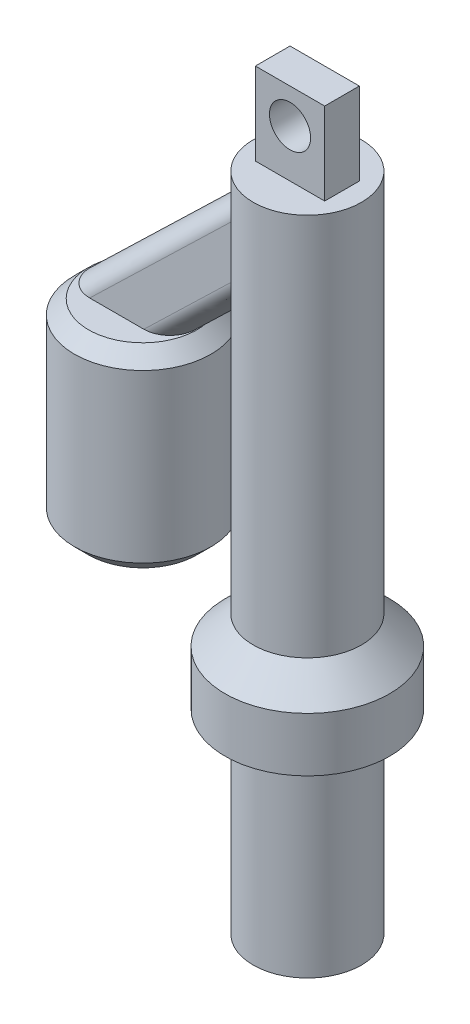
ISO-10303-21;
HEADER;
FILE_DESCRIPTION(('STEP AP214'),'2;1');
FILE_NAME('part.step','',(''),(''),'','','');
FILE_SCHEMA(('AUTOMOTIVE_DESIGN { 1 0 10303 214 1 1 1 1 }'));
ENDSEC;
DATA;
#1=APPLICATION_CONTEXT('core data for automotive mechanical design processes');
#2=APPLICATION_PROTOCOL_DEFINITION('international standard','automotive_design',2000,#1);
#3=PRODUCT_CONTEXT('',#1,'mechanical');
#4=PRODUCT('Part','Part','',(#3));
#5=PRODUCT_RELATED_PRODUCT_CATEGORY('part','',(#4));
#6=PRODUCT_DEFINITION_FORMATION('','',#4);
#7=PRODUCT_DEFINITION_CONTEXT('part definition',#1,'design');
#8=PRODUCT_DEFINITION('design','',#6,#7);
#9=PRODUCT_DEFINITION_SHAPE('','',#8);
#10=(LENGTH_UNIT() NAMED_UNIT(*) SI_UNIT(.MILLI.,.METRE.));
#11=(NAMED_UNIT(*) PLANE_ANGLE_UNIT() SI_UNIT($,.RADIAN.));
#12=(NAMED_UNIT(*) SI_UNIT($,.STERADIAN.) SOLID_ANGLE_UNIT());
#13=UNCERTAINTY_MEASURE_WITH_UNIT(LENGTH_MEASURE(1.E-05),#10,'distance_accuracy_value','');
#14=(GEOMETRIC_REPRESENTATION_CONTEXT(3) GLOBAL_UNCERTAINTY_ASSIGNED_CONTEXT((#13)) GLOBAL_UNIT_ASSIGNED_CONTEXT((#10,
#11,#12)) REPRESENTATION_CONTEXT('',''));
#15=CARTESIAN_POINT('',(0.,0.,0.));
#16=DIRECTION('',(0.,0.,1.));
#17=DIRECTION('',(1.,0.,0.));
#18=AXIS2_PLACEMENT_3D('',#15,#16,#17);
#19=CARTESIAN_POINT('',(0.,305.,0.));
#20=DIRECTION('',(0.,-1.,0.));
#21=DIRECTION('',(0.,0.,-1.));
#22=AXIS2_PLACEMENT_3D('',#19,#20,#21);
#23=CYLINDRICAL_SURFACE('',#22,25.);
#24=CARTESIAN_POINT('',(0.,90.,0.));
#25=DIRECTION('',(0.,-1.,0.));
#26=DIRECTION('',(0.,0.,-1.));
#27=AXIS2_PLACEMENT_3D('',#24,#25,#26);
#28=CIRCLE('',#27,25.);
#29=CARTESIAN_POINT('',(0.,90.,-25.));
#30=VERTEX_POINT('',#29);
#31=EDGE_CURVE('E697',#30,#30,#28,.T.);
#32=ORIENTED_EDGE('',*,*,#31,.T.);
#33=EDGE_LOOP('',(#32));
#34=FACE_BOUND('',#33,.T.);
#35=CARTESIAN_POINT('',(0.,0.,0.));
#36=DIRECTION('',(0.,1.,0.));
#37=DIRECTION('',(0.,0.,1.));
#38=AXIS2_PLACEMENT_3D('',#35,#36,#37);
#39=CIRCLE('',#38,25.);
#40=CARTESIAN_POINT('',(0.,0.,25.));
#41=VERTEX_POINT('',#40);
#42=EDGE_CURVE('E244',#41,#41,#39,.T.);
#43=ORIENTED_EDGE('',*,*,#42,.T.);
#44=EDGE_LOOP('',(#43));
#45=FACE_BOUND('',#44,.T.);
#46=ADVANCED_FACE('F35',(#34,#45),#23,.T.);
#47=CARTESIAN_POINT('',(0.,0.,0.));
#48=DIRECTION('',(0.,1.,0.));
#49=DIRECTION('',(0.,0.,1.));
#50=AXIS2_PLACEMENT_3D('',#47,#48,#49);
#51=PLANE('',#50);
#52=ORIENTED_EDGE('',*,*,#42,.F.);
#53=EDGE_LOOP('',(#52));
#54=FACE_BOUND('',#53,.T.);
#55=CARTESIAN_POINT('',(0.,0.,0.));
#56=DIRECTION('',(0.,1.,0.));
#57=DIRECTION('',(0.,0.,1.));
#58=AXIS2_PLACEMENT_3D('',#55,#56,#57);
#59=CIRCLE('',#58,16.);
#60=CARTESIAN_POINT('',(0.,0.,16.));
#61=VERTEX_POINT('',#60);
#62=EDGE_CURVE('E202',#61,#61,#59,.F.);
#63=ORIENTED_EDGE('',*,*,#62,.F.);
#64=EDGE_LOOP('',(#63));
#65=FACE_BOUND('',#64,.T.);
#66=ADVANCED_FACE('F313',(#54,#65),#51,.F.);
#67=CARTESIAN_POINT('',(0.,0.,0.));
#68=DIRECTION('',(0.,1.,0.));
#69=DIRECTION('',(0.,0.,1.));
#70=AXIS2_PLACEMENT_3D('',#67,#68,#69);
#71=CYLINDRICAL_SURFACE('',#70,16.);
#72=ORIENTED_EDGE('',*,*,#62,.T.);
#73=EDGE_LOOP('',(#72));
#74=FACE_BOUND('',#73,.T.);
#75=CARTESIAN_POINT('',(0.,2.5,0.));
#76=DIRECTION('',(0.,1.,0.));
#77=DIRECTION('',(0.,0.,1.));
#78=AXIS2_PLACEMENT_3D('',#75,#76,#77);
#79=CIRCLE('',#78,16.);
#80=CARTESIAN_POINT('',(0.,2.5,16.));
#81=VERTEX_POINT('',#80);
#82=EDGE_CURVE('E213',#81,#81,#79,.F.);
#83=ORIENTED_EDGE('',*,*,#82,.F.);
#84=EDGE_LOOP('',(#83));
#85=FACE_BOUND('',#84,.T.);
#86=ADVANCED_FACE('F320',(#74,#85),#71,.F.);
#87=CARTESIAN_POINT('',(0.,2.5,0.));
#88=DIRECTION('',(0.,1.,0.));
#89=DIRECTION('',(0.,0.,1.));
#90=AXIS2_PLACEMENT_3D('',#87,#88,#89);
#91=PLANE('',#90);
#92=CARTESIAN_POINT('',(0.,2.5,0.));
#93=DIRECTION('',(0.,1.,0.));
#94=DIRECTION('',(0.,0.,1.));
#95=AXIS2_PLACEMENT_3D('',#92,#93,#94);
#96=CIRCLE('',#95,22.5);
#97=CARTESIAN_POINT('',(0.,2.5,22.5));
#98=VERTEX_POINT('',#97);
#99=EDGE_CURVE('E656',#98,#98,#96,.T.);
#100=ORIENTED_EDGE('',*,*,#99,.T.);
#101=EDGE_LOOP('',(#100));
#102=FACE_BOUND('',#101,.T.);
#103=ORIENTED_EDGE('',*,*,#82,.T.);
#104=EDGE_LOOP('',(#103));
#105=FACE_BOUND('',#104,.T.);
#106=ADVANCED_FACE('F511',(#102,#105),#91,.T.);
#107=CARTESIAN_POINT('',(0.,305.,0.));
#108=DIRECTION('',(0.,-1.,0.));
#109=DIRECTION('',(0.,0.,-1.));
#110=AXIS2_PLACEMENT_3D('',#107,#108,#109);
#111=CYLINDRICAL_SURFACE('',#110,22.5);
#112=ORIENTED_EDGE('',*,*,#99,.F.);
#113=EDGE_LOOP('',(#112));
#114=FACE_BOUND('',#113,.T.);
#115=CARTESIAN_POINT('',(0.,302.5,0.));
#116=DIRECTION('',(0.,1.,0.));
#117=DIRECTION('',(0.,0.,1.));
#118=AXIS2_PLACEMENT_3D('',#115,#116,#117);
#119=CIRCLE('',#118,22.5);
#120=CARTESIAN_POINT('',(0.,302.5,22.5));
#121=VERTEX_POINT('',#120);
#122=EDGE_CURVE('E212',#121,#121,#119,.T.);
#123=ORIENTED_EDGE('',*,*,#122,.T.);
#124=EDGE_LOOP('',(#123));
#125=FACE_BOUND('',#124,.T.);
#126=DIRECTION('',(0.,-1.,0.));
#127=VECTOR('',#126,1.);
#128=CARTESIAN_POINT('',(-20.3960780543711,281.76719294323,9.50000000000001));
#129=LINE('',#128,#127);
#130=CARTESIAN_POINT('',(-20.3960780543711,281.76719294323,9.50000000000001));
#131=VERTEX_POINT('',#130);
#132=CARTESIAN_POINT('',(-20.3960780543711,257.624973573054,9.5));
#133=VERTEX_POINT('',#132);
#134=EDGE_CURVE('E651',#131,#133,#129,.T.);
#135=ORIENTED_EDGE('',*,*,#134,.F.);
#136=CARTESIAN_POINT('',(-20.3960780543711,281.76719294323,-9.5));
#137=CARTESIAN_POINT('',(-20.3960742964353,281.860220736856,-9.50000397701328));
#138=CARTESIAN_POINT('',(-20.3970286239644,281.953262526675,-9.49795891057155));
#139=CARTESIAN_POINT('',(-20.4009440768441,282.139205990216,-9.48954812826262));
#140=CARTESIAN_POINT('',(-20.4039073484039,282.232107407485,-9.48317779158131));
#141=CARTESIAN_POINT('',(-20.4119327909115,282.417426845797,-9.4658906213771));
#142=CARTESIAN_POINT('',(-20.4169955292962,282.509844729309,-9.45497255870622));
#143=CARTESIAN_POINT('',(-20.4292624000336,282.693682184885,-9.42843849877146));
#144=CARTESIAN_POINT('',(-20.4364624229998,282.785103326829,-9.41283151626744));
#145=CARTESIAN_POINT('',(-20.4530256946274,282.966764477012,-9.37678693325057));
#146=CARTESIAN_POINT('',(-20.462388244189,283.057004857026,-9.35635089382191));
#147=CARTESIAN_POINT('',(-20.4832543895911,283.235966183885,-9.31058107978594));
#148=CARTESIAN_POINT('',(-20.4947577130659,283.324687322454,-9.28524792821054));
#149=CARTESIAN_POINT('',(-20.5264072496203,283.546167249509,-9.21513818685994));
#150=CARTESIAN_POINT('',(-20.547929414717,283.677721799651,-9.16711742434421));
#151=CARTESIAN_POINT('',(-20.5954131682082,283.935375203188,-9.05993283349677));
#152=CARTESIAN_POINT('',(-20.6213752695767,284.061473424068,-9.0007677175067));
#153=CARTESIAN_POINT('',(-20.6771237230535,284.307121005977,-8.87194838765));
#154=CARTESIAN_POINT('',(-20.7069059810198,284.426677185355,-8.80230538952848));
#155=CARTESIAN_POINT('',(-20.769610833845,284.658690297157,-8.65331126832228));
#156=CARTESIAN_POINT('',(-20.8025336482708,284.7711467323,-8.57395946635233));
#157=CARTESIAN_POINT('',(-20.8762085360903,285.00590996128,-8.39314558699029));
#158=CARTESIAN_POINT('',(-20.9173717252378,285.126926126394,-8.29017575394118));
#159=CARTESIAN_POINT('',(-21.0017408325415,285.358695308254,-8.07405360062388));
#160=CARTESIAN_POINT('',(-21.0449471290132,285.469446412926,-7.96089939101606));
#161=CARTESIAN_POINT('',(-21.1324363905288,285.681118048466,-7.72566554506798));
#162=CARTESIAN_POINT('',(-21.1767215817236,285.782015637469,-7.60356618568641));
#163=CARTESIAN_POINT('',(-21.265366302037,285.974170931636,-7.35200722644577));
#164=CARTESIAN_POINT('',(-21.3097258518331,286.065425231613,-7.22254505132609));
#165=CARTESIAN_POINT('',(-21.4201408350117,286.283006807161,-6.88998405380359));
#166=CARTESIAN_POINT('',(-21.4857486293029,286.403548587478,-6.68294072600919));
#167=CARTESIAN_POINT('',(-21.6133204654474,286.626170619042,-6.25808872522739));
#168=CARTESIAN_POINT('',(-21.6752826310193,286.728241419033,-6.04027461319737));
#169=CARTESIAN_POINT('',(-21.7941904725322,286.916101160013,-5.59608685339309));
#170=CARTESIAN_POINT('',(-21.851129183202,287.001867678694,-5.36970192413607));
#171=CARTESIAN_POINT('',(-21.9588721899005,287.158746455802,-4.91055973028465));
#172=CARTESIAN_POINT('',(-22.0096767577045,287.229859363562,-4.67780274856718));
#173=CARTESIAN_POINT('',(-22.1287365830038,287.392091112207,-4.08664201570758));
#174=CARTESIAN_POINT('',(-22.1925807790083,287.474768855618,-3.72501330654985));
#175=CARTESIAN_POINT('',(-22.30296058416,287.614054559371,-2.99412346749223));
#176=CARTESIAN_POINT('',(-22.3494878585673,287.67064996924,-2.62485875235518));
#177=CARTESIAN_POINT('',(-22.4243418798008,287.760346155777,-1.88115620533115));
#178=CARTESIAN_POINT('',(-22.4526430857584,287.793413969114,-1.50671186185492));
#179=CARTESIAN_POINT('',(-22.4904500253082,287.837372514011,-0.755672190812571));
#180=CARTESIAN_POINT('',(-22.499959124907,287.848267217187,-0.379077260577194));
#181=CARTESIAN_POINT('',(-22.50004167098,287.848364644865,0.384001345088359));
#182=CARTESIAN_POINT('',(-22.4901123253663,287.8369913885,0.770485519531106));
#183=CARTESIAN_POINT('',(-22.4504753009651,287.790881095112,1.54113378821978));
#184=CARTESIAN_POINT('',(-22.4207627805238,287.756138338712,1.92529729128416));
#185=CARTESIAN_POINT('',(-22.3421489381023,287.661761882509,2.68791586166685));
#186=CARTESIAN_POINT('',(-22.2932851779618,287.602176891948,3.06638060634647));
#187=CARTESIAN_POINT('',(-22.206430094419,287.492020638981,3.62772459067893));
#188=CARTESIAN_POINT('',(-22.1752239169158,287.451845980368,3.81375428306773));
#189=CARTESIAN_POINT('',(-22.1084954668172,287.364055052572,4.18325750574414));
#190=CARTESIAN_POINT('',(-22.0729737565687,287.316439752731,4.36673136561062));
#191=CARTESIAN_POINT('',(-21.9926015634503,287.205934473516,4.75608333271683));
#192=CARTESIAN_POINT('',(-21.9471413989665,287.14183892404,4.96149632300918));
#193=CARTESIAN_POINT('',(-21.8514633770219,287.002158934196,5.36721219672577));
#194=CARTESIAN_POINT('',(-21.8012466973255,286.92657733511,5.56751632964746));
#195=CARTESIAN_POINT('',(-21.6967850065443,286.76272191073,5.96163099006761));
#196=CARTESIAN_POINT('',(-21.6425430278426,286.67445759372,6.15544624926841));
#197=CARTESIAN_POINT('',(-21.5309526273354,286.483778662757,6.53507276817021));
#198=CARTESIAN_POINT('',(-21.4736049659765,286.381367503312,6.72088596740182));
#199=CARTESIAN_POINT('',(-21.3711524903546,286.187474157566,7.03879550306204));
#200=CARTESIAN_POINT('',(-21.3264301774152,286.099311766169,7.17304022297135));
#201=CARTESIAN_POINT('',(-21.2366816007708,285.913335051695,7.43454396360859));
#202=CARTESIAN_POINT('',(-21.1916554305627,285.815523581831,7.56180503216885));
#203=CARTESIAN_POINT('',(-21.1022292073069,285.609814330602,7.80788339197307));
#204=CARTESIAN_POINT('',(-21.0578284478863,285.501929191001,7.92671094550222));
#205=CARTESIAN_POINT('',(-20.970648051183,285.275640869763,8.15455651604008));
#206=CARTESIAN_POINT('',(-20.9278680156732,285.157240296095,8.26357695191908));
#207=CARTESIAN_POINT('',(-20.8532390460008,284.934236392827,8.44987760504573));
#208=CARTESIAN_POINT('',(-20.8208936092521,284.831491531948,8.52918595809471));
#209=CARTESIAN_POINT('',(-20.7586547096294,284.619452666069,8.67956651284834));
#210=CARTESIAN_POINT('',(-20.7287606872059,284.510160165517,8.75064059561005));
#211=CARTESIAN_POINT('',(-20.6720600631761,284.28551234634,8.8837587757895));
#212=CARTESIAN_POINT('',(-20.645251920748,284.170160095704,8.94580738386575));
#213=CARTESIAN_POINT('',(-20.5952677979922,283.934020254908,9.06028973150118));
#214=CARTESIAN_POINT('',(-20.5720917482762,283.813232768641,9.11272365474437));
#215=CARTESIAN_POINT('',(-20.5297817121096,283.566890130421,9.20764746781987));
#216=CARTESIAN_POINT('',(-20.5106545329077,283.441327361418,9.25012062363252));
#217=CARTESIAN_POINT('',(-20.4767782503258,283.186618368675,9.32487207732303));
#218=CARTESIAN_POINT('',(-20.4620296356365,283.0574717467,9.3571492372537));
#219=CARTESIAN_POINT('',(-20.4370231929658,282.79666695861,9.41164075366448));
#220=CARTESIAN_POINT('',(-20.4267652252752,282.665008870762,9.43385542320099));
#221=CARTESIAN_POINT('',(-20.4106783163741,282.40020749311,9.46861015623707));
#222=CARTESIAN_POINT('',(-20.404847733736,282.26706477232,9.48115380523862));
#223=CARTESIAN_POINT('',(-20.3994205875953,282.072569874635,9.49282103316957));
#224=CARTESIAN_POINT('',(-20.3981580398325,282.011451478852,9.49553333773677));
#225=CARTESIAN_POINT('',(-20.3964876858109,281.889287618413,9.49912065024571));
#226=CARTESIAN_POINT('',(-20.3960779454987,281.82824230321,9.49999981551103));
#227=CARTESIAN_POINT('',(-20.3960780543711,281.76719294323,9.50000000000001));
#228=B_SPLINE_CURVE_WITH_KNOTS('',3,(#136,#137,#138,#139,#140,#141,#142,#143,#144,#145,#146,
#147,#148,#149,#150,#151,#152,#153,#154,#155,#156,#157,#158,#159,#160,#161,#162,#163,#164,#165,
#166,#167,#168,#169,#170,#171,#172,#173,#174,#175,#176,#177,#178,#179,#180,#181,#182,#183,#184,
#185,#186,#187,#188,#189,#190,#191,#192,#193,#194,#195,#196,#197,#198,#199,#200,#201,#202,#203,
#204,#205,#206,#207,#208,#209,#210,#211,#212,#213,#214,#215,#216,#217,#218,#219,#220,#221,#222,
#223,#224,#225,#226,#227),.UNSPECIFIED.,.F.,.F.,(4,2,2,2,2,2,2,2,2,2,2,2,2,2,2,2,2,2,2,2,2,2,2,
2,2,2,2,2,2,2,2,2,2,2,2,2,2,2,2,2,2,2,2,2,2,4),(0.,0.279076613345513,0.558451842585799,
0.837902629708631,1.11681955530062,1.39564643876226,1.67443787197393,2.09885477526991,
2.52332074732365,2.94733555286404,3.37138002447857,3.86307329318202,4.3548579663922,
4.84776164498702,5.34083879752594,6.08485285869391,6.82924654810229,7.57465666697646,
8.32003374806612,9.44764043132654,10.5757891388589,11.7055153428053,12.8350391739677,
13.9941652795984,15.1535751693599,16.3107223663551,16.8891307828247,17.4674639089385,
18.1268758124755,18.7861248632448,19.4448822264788,20.1034790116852,20.6032591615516,
21.1028919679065,21.6019059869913,22.1007965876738,22.5016869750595,22.9024856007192,
23.3030832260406,23.7036731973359,24.1049314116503,24.5062343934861,24.9075248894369,
25.3086665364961,25.4922141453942,25.6753450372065),.UNSPECIFIED.);
#229=CARTESIAN_POINT('',(-20.3960780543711,281.76719294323,-9.5));
#230=VERTEX_POINT('',#229);
#231=EDGE_CURVE('E181',#230,#131,#228,.T.);
#232=ORIENTED_EDGE('',*,*,#231,.F.);
#233=DIRECTION('',(0.,-1.,0.));
#234=VECTOR('',#233,1.);
#235=CARTESIAN_POINT('',(-20.3960780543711,281.76719294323,-9.5));
#236=LINE('',#235,#234);
#237=CARTESIAN_POINT('',(-20.3960780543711,257.624973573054,-9.50000000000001));
#238=VERTEX_POINT('',#237);
#239=EDGE_CURVE('E638',#230,#238,#236,.T.);
#240=ORIENTED_EDGE('',*,*,#239,.T.);
#241=CARTESIAN_POINT('',(-20.3960780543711,257.624973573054,9.5));
#242=CARTESIAN_POINT('',(-20.3960745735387,257.494458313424,9.49999766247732));
#243=CARTESIAN_POINT('',(-20.3979497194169,257.363993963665,9.49598189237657));
#244=CARTESIAN_POINT('',(-20.4050993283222,257.103916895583,9.48061390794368));
#245=CARTESIAN_POINT('',(-20.4103651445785,256.974302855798,9.46928035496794));
#246=CARTESIAN_POINT('',(-20.4239370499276,256.716097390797,9.43997040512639));
#247=CARTESIAN_POINT('',(-20.4322410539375,256.587505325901,9.42199856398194));
#248=CARTESIAN_POINT('',(-20.4514695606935,256.332540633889,9.38018764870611));
#249=CARTESIAN_POINT('',(-20.4623727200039,256.206158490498,9.35639632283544));
#250=CARTESIAN_POINT('',(-20.4865282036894,255.954685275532,9.30338698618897));
#251=CARTESIAN_POINT('',(-20.4997820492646,255.829595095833,9.27416546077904));
#252=CARTESIAN_POINT('',(-20.5283526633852,255.580879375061,9.21075168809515));
#253=CARTESIAN_POINT('',(-20.543670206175,255.457254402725,9.17655757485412));
#254=CARTESIAN_POINT('',(-20.5867576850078,255.130922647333,9.07963557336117));
#255=CARTESIAN_POINT('',(-20.6160990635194,254.929599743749,9.01291652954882));
#256=CARTESIAN_POINT('',(-20.6787104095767,254.531617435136,8.86832253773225));
#257=CARTESIAN_POINT('',(-20.7119812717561,254.334959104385,8.7904450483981));
#258=CARTESIAN_POINT('',(-20.7816172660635,253.946510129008,8.62452783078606));
#259=CARTESIAN_POINT('',(-20.8179829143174,253.754720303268,8.53648640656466));
#260=CARTESIAN_POINT('',(-20.8933546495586,253.374933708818,8.35032262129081));
#261=CARTESIAN_POINT('',(-20.9323773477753,253.18697261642,8.25213438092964));
#262=CARTESIAN_POINT('',(-21.0121996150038,252.816504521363,8.04671414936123));
#263=CARTESIAN_POINT('',(-21.0529987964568,252.633996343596,7.93948412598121));
#264=CARTESIAN_POINT('',(-21.1358197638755,252.274695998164,7.71630037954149));
#265=CARTESIAN_POINT('',(-21.1778415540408,252.097903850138,7.60034662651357));
#266=CARTESIAN_POINT('',(-21.286818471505,251.651042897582,7.29119342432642));
#267=CARTESIAN_POINT('',(-21.3542992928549,251.3854036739,7.0917172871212));
#268=CARTESIAN_POINT('',(-21.4891224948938,250.870896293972,6.67204707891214));
#269=CARTESIAN_POINT('',(-21.5564648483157,250.622031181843,6.45184926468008));
#270=CARTESIAN_POINT('',(-21.6888600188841,250.14454317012,5.99169837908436));
#271=CARTESIAN_POINT('',(-21.7539208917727,249.915843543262,5.75182754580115));
#272=CARTESIAN_POINT('',(-21.8800557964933,249.480855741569,5.25163002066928));
#273=CARTESIAN_POINT('',(-21.9411317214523,249.274556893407,4.99131317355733));
#274=CARTESIAN_POINT('',(-22.038995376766,248.948880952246,4.53527734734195));
#275=CARTESIAN_POINT('',(-22.077397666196,248.822520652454,4.34487111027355));
#276=CARTESIAN_POINT('',(-22.1505871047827,248.583774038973,3.95484955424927));
#277=CARTESIAN_POINT('',(-22.1853752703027,248.471383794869,3.75523684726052));
#278=CARTESIAN_POINT('',(-22.2505789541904,248.262209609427,3.34729595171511));
#279=CARTESIAN_POINT('',(-22.2809948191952,248.16542443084,3.13896845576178));
#280=CARTESIAN_POINT('',(-22.3366921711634,247.989167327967,2.71440729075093));
#281=CARTESIAN_POINT('',(-22.3619735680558,247.909695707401,2.49817348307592));
#282=CARTESIAN_POINT('',(-22.4068998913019,247.769040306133,2.05682088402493));
#283=CARTESIAN_POINT('',(-22.4264858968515,247.708047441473,1.83163484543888));
#284=CARTESIAN_POINT('',(-22.4590381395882,247.606940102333,1.37612636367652));
#285=CARTESIAN_POINT('',(-22.4720044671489,247.566825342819,1.14580399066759));
#286=CARTESIAN_POINT('',(-22.4908469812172,247.508598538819,0.6823069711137));
#287=CARTESIAN_POINT('',(-22.4967296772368,247.49046629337,0.449135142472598));
#288=CARTESIAN_POINT('',(-22.5012043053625,247.476670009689,-0.017930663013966));
#289=CARTESIAN_POINT('',(-22.4997971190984,247.481003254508,-0.251824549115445));
#290=CARTESIAN_POINT('',(-22.4904574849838,247.509815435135,-0.685216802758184));
#291=CARTESIAN_POINT('',(-22.4834683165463,247.531382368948,-0.884936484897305));
#292=CARTESIAN_POINT('',(-22.4643420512,247.590543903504,-1.2817068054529));
#293=CARTESIAN_POINT('',(-22.4522056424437,247.628136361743,-1.47875779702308));
#294=CARTESIAN_POINT('',(-22.4230917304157,247.718625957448,-1.86903038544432));
#295=CARTESIAN_POINT('',(-22.4061119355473,247.771530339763,-2.06225012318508));
#296=CARTESIAN_POINT('',(-22.3677214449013,247.891680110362,-2.44372861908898));
#297=CARTESIAN_POINT('',(-22.3463100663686,247.958927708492,-2.63198660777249));
#298=CARTESIAN_POINT('',(-22.2930975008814,248.126977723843,-3.05360147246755));
#299=CARTESIAN_POINT('',(-22.2600575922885,248.231923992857,-3.28515577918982));
#300=CARTESIAN_POINT('',(-22.188565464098,248.461047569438,-3.7376576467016));
#301=CARTESIAN_POINT('',(-22.1501119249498,248.585229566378,-3.95860260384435));
#302=CARTESIAN_POINT('',(-22.0687814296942,248.850732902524,-4.38941935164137));
#303=CARTESIAN_POINT('',(-22.0258991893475,248.992074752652,-4.59927745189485));
#304=CARTESIAN_POINT('',(-21.9367458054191,249.289734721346,-5.00727474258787));
#305=CARTESIAN_POINT('',(-21.890474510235,249.44605350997,-5.20541340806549));
#306=CARTESIAN_POINT('',(-21.7788859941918,249.828797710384,-5.65698671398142));
#307=CARTESIAN_POINT('',(-21.7125580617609,250.060649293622,-5.90558349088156));
#308=CARTESIAN_POINT('',(-21.57754578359,250.544874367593,-6.38127571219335));
#309=CARTESIAN_POINT('',(-21.5088604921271,250.797256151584,-6.60836238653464));
#310=CARTESIAN_POINT('',(-21.3709599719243,251.320531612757,-7.04158257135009));
#311=CARTESIAN_POINT('',(-21.3017437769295,251.591477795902,-7.24765217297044));
#312=CARTESIAN_POINT('',(-21.1650166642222,252.149144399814,-7.63771841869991));
#313=CARTESIAN_POINT('',(-21.0975052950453,252.435860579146,-7.8217209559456));
#314=CARTESIAN_POINT('',(-20.9950816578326,252.894955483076,-8.09118723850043));
#315=CARTESIAN_POINT('',(-20.9588330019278,253.062458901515,-8.18453392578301));
#316=CARTESIAN_POINT('',(-20.8880029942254,253.401825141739,-8.36364776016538));
#317=CARTESIAN_POINT('',(-20.8534215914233,253.57368782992,-8.44941513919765));
#318=CARTESIAN_POINT('',(-20.7864053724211,253.921651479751,-8.61296483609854));
#319=CARTESIAN_POINT('',(-20.7539712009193,254.097753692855,-8.69074475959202));
#320=CARTESIAN_POINT('',(-20.6920320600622,254.452794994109,-8.83719904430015));
#321=CARTESIAN_POINT('',(-20.6625088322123,254.631706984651,-8.90593120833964));
#322=CARTESIAN_POINT('',(-20.6067951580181,254.993321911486,-9.03409521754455));
#323=CARTESIAN_POINT('',(-20.5806039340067,255.176023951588,-9.09352923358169));
#324=CARTESIAN_POINT('',(-20.5323272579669,255.544895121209,-9.20201363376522));
#325=CARTESIAN_POINT('',(-20.5102396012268,255.73106232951,-9.2510695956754));
#326=CARTESIAN_POINT('',(-20.4616413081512,256.196798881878,-9.35821640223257));
#327=CARTESIAN_POINT('',(-20.4380818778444,256.478383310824,-9.40937497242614));
#328=CARTESIAN_POINT('',(-20.4134884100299,256.905129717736,-9.46255097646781));
#329=CARTESIAN_POINT('',(-20.407078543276,257.048555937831,-9.47635512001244));
#330=CARTESIAN_POINT('',(-20.3983686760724,257.33627743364,-9.49508333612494));
#331=CARTESIAN_POINT('',(-20.396073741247,257.480573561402,-9.49999646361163));
#332=CARTESIAN_POINT('',(-20.3960780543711,257.624973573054,-9.50000000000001));
#333=B_SPLINE_CURVE_WITH_KNOTS('',3,(#241,#242,#243,#244,#245,#246,#247,#248,#249,#250,#251,
#252,#253,#254,#255,#256,#257,#258,#259,#260,#261,#262,#263,#264,#265,#266,#267,#268,#269,#270,
#271,#272,#273,#274,#275,#276,#277,#278,#279,#280,#281,#282,#283,#284,#285,#286,#287,#288,#289,
#290,#291,#292,#293,#294,#295,#296,#297,#298,#299,#300,#301,#302,#303,#304,#305,#306,#307,#308,
#309,#310,#311,#312,#313,#314,#315,#316,#317,#318,#319,#320,#321,#322,#323,#324,#325,#326,#327,
#328,#329,#330,#331,#332),.UNSPECIFIED.,.F.,.F.,(4,2,2,2,2,2,2,2,2,2,2,2,2,2,2,2,2,2,2,2,2,2,2,
2,2,2,2,2,2,2,2,2,2,2,2,2,2,2,2,2,2,2,2,2,2,4),(0.,0.391396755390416,0.781799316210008,
1.1719344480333,1.55897004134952,1.94625701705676,2.33368969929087,2.9755635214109,
3.6175837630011,4.25971128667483,4.90630662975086,5.55276161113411,6.19921881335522,
7.21509486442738,8.23115478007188,9.2431649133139,10.2546907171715,10.949312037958,
11.643737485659,12.3381078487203,13.0324903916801,13.7338199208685,14.4351398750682,
15.1358148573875,15.8364051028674,16.4386938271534,17.0409020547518,17.6433956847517,
18.245982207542,19.0139469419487,19.7820991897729,20.5511788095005,21.3202928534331,
22.3578524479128,23.395833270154,24.4368817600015,25.4776516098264,26.0629423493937,
26.6482151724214,27.2336629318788,27.8151673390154,28.3965357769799,28.9775909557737,
29.8370409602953,30.2694412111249,30.7023733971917),.UNSPECIFIED.);
#334=EDGE_CURVE('E623',#133,#238,#333,.T.);
#335=ORIENTED_EDGE('',*,*,#334,.F.);
#336=EDGE_LOOP('',(#135,#232,#240,#335));
#337=FACE_BOUND('',#336,.T.);
#338=ADVANCED_FACE('F173',(#114,#125,#337),#111,.F.);
#339=CARTESIAN_POINT('',(0.,302.5,0.));
#340=DIRECTION('',(0.,1.,0.));
#341=DIRECTION('',(0.,0.,1.));
#342=AXIS2_PLACEMENT_3D('',#339,#340,#341);
#343=PLANE('',#342);
#344=ORIENTED_EDGE('',*,*,#122,.F.);
#345=EDGE_LOOP('',(#344));
#346=FACE_BOUND('',#345,.T.);
#347=ADVANCED_FACE('F524',(#346),#343,.F.);
#348=CARTESIAN_POINT('',(14.7044553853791,315.663384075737,9.50000000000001));
#349=DIRECTION('',(0.,0.,-1.));
#350=DIRECTION('',(0.,1.,0.));
#351=AXIS2_PLACEMENT_3D('',#348,#349,#350);
#352=PLANE('',#351);
#353=ORIENTED_EDGE('',*,*,#134,.T.);
#354=DIRECTION('',(-0.719339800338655,-0.694658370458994,0.));
#355=VECTOR('',#354,1.);
#356=CARTESIAN_POINT('',(39.7044553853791,315.663384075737,9.5));
#357=LINE('',#356,#355);
#358=CARTESIAN_POINT('',(-66.0888257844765,213.5,9.5));
#359=VERTEX_POINT('',#358);
#360=EDGE_CURVE('E639',#133,#359,#357,.T.);
#361=ORIENTED_EDGE('',*,*,#360,.T.);
#362=DIRECTION('',(1.,0.,0.));
#363=VECTOR('',#362,1.);
#364=CARTESIAN_POINT('',(-76.,213.5,9.50000000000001));
#365=LINE('',#364,#363);
#366=CARTESIAN_POINT('',(-91.0888257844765,213.5,9.50000000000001));
#367=VERTEX_POINT('',#366);
#368=EDGE_CURVE('E147',#367,#359,#365,.T.);
#369=ORIENTED_EDGE('',*,*,#368,.F.);
#370=DIRECTION('',(-0.719339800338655,-0.694658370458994,0.));
#371=VECTOR('',#370,1.);
#372=CARTESIAN_POINT('',(14.7044553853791,315.663384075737,9.50000000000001));
#373=LINE('',#372,#371);
#374=EDGE_CURVE('E144',#131,#367,#373,.T.);
#375=ORIENTED_EDGE('',*,*,#374,.F.);
#376=EDGE_LOOP('',(#353,#361,#369,#375));
#377=FACE_BOUND('',#376,.T.);
#378=ADVANCED_FACE('F532',(#377),#352,.T.);
#379=CARTESIAN_POINT('',(39.7044553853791,315.663384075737,0.));
#380=DIRECTION('',(0.,1.,0.));
#381=DIRECTION('',(0.,0.,1.));
#382=AXIS2_PLACEMENT_3D('',#379,#380,#381);
#383=CIRCLE('',#382,12.);
#384=DIRECTION('',(-0.719339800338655,-0.694658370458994,0.));
#385=VECTOR('',#384,1.);
#386=SURFACE_OF_LINEAR_EXTRUSION('',#383,#385);
#387=OFFSET_SURFACE('',#386,2.5,.F.);
#388=ORIENTED_EDGE('',*,*,#334,.T.);
#389=DIRECTION('',(-0.719339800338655,-0.694658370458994,0.));
#390=VECTOR('',#389,1.);
#391=CARTESIAN_POINT('',(39.7044553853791,315.663384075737,-9.50000000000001));
#392=LINE('',#391,#390);
#393=CARTESIAN_POINT('',(-66.0888257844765,213.5,-9.50000000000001));
#394=VERTEX_POINT('',#393);
#395=EDGE_CURVE('E641',#238,#394,#392,.T.);
#396=ORIENTED_EDGE('',*,*,#395,.T.);
#397=CARTESIAN_POINT('',(-66.0888257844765,213.5,9.5));
#398=CARTESIAN_POINT('',(-65.9905789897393,213.5,9.50000260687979));
#399=CARTESIAN_POINT('',(-65.8923448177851,213.5,9.49787620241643));
#400=CARTESIAN_POINT('',(-65.6960643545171,213.5,9.48939366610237));
#401=CARTESIAN_POINT('',(-65.5980180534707,213.5,9.48303775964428));
#402=CARTESIAN_POINT('',(-65.3045652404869,213.5,9.45768309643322));
#403=CARTESIAN_POINT('',(-65.109667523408,213.5,9.43239729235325));
#404=CARTESIAN_POINT('',(-64.723720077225,213.5,9.36581927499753));
#405=CARTESIAN_POINT('',(-64.5326555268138,213.5,9.32461171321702));
#406=CARTESIAN_POINT('',(-64.1544260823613,213.5,9.22700323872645));
#407=CARTESIAN_POINT('',(-63.9672618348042,213.5,9.17059982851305));
#408=CARTESIAN_POINT('',(-63.5950134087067,213.5,9.04255371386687));
#409=CARTESIAN_POINT('',(-63.4100052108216,213.5,8.97069045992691));
#410=CARTESIAN_POINT('',(-63.0459617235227,213.5,8.81327884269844));
#411=CARTESIAN_POINT('',(-62.8669262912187,213.5,8.72773080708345));
#412=CARTESIAN_POINT('',(-62.3393573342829,213.5,8.45171407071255));
#413=CARTESIAN_POINT('',(-62.0007164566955,213.5,8.24199750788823));
#414=CARTESIAN_POINT('',(-61.3059668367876,213.5,7.74340368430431));
#415=CARTESIAN_POINT('',(-60.9550581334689,213.5,7.44733370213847));
#416=CARTESIAN_POINT('',(-60.3007748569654,213.5,6.80652837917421));
#417=CARTESIAN_POINT('',(-59.9974114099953,213.5,6.46178168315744));
#418=CARTESIAN_POINT('',(-59.5637170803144,213.5,5.89172803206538));
#419=CARTESIAN_POINT('',(-59.4155317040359,213.5,5.67972077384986));
#420=CARTESIAN_POINT('',(-59.1364156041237,213.5,5.24465375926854));
#421=CARTESIAN_POINT('',(-59.0054809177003,213.5,5.02159655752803));
#422=CARTESIAN_POINT('',(-58.7613695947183,213.5,4.56580661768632));
#423=CARTESIAN_POINT('',(-58.6482043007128,213.5,4.33306781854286));
#424=CARTESIAN_POINT('',(-58.4402406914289,213.5,3.85960953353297));
#425=CARTESIAN_POINT('',(-58.3454371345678,213.5,3.61889234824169));
#426=CARTESIAN_POINT('',(-58.1682090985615,213.5,3.11274702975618));
#427=CARTESIAN_POINT('',(-58.0872289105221,213.5,2.84681223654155));
#428=CARTESIAN_POINT('',(-57.9472903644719,213.5,2.30920472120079));
#429=CARTESIAN_POINT('',(-57.8883331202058,213.5,2.03753170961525));
#430=CARTESIAN_POINT('',(-57.7927313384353,213.5,1.49028640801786));
#431=CARTESIAN_POINT('',(-57.7560869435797,213.5,1.21471409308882));
#432=CARTESIAN_POINT('',(-57.7052809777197,213.5,0.661408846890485));
#433=CARTESIAN_POINT('',(-57.6911274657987,213.5,0.383675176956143));
#434=CARTESIAN_POINT('',(-57.6853045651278,213.5,-0.18108641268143));
#435=CARTESIAN_POINT('',(-57.6943827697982,213.5,-0.468122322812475));
#436=CARTESIAN_POINT('',(-57.7365740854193,213.5,-1.04053231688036));
#437=CARTESIAN_POINT('',(-57.7696964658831,213.5,-1.32590571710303));
#438=CARTESIAN_POINT('',(-57.8597968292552,213.5,-1.8927509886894));
#439=CARTESIAN_POINT('',(-57.9167655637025,213.5,-2.17422432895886));
#440=CARTESIAN_POINT('',(-58.0542931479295,213.5,-2.73148994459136));
#441=CARTESIAN_POINT('',(-58.1348629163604,213.5,-3.00727952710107));
#442=CARTESIAN_POINT('',(-58.3193253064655,213.5,-3.55150013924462));
#443=CARTESIAN_POINT('',(-58.4232592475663,213.5,-3.819917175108));
#444=CARTESIAN_POINT('',(-58.6537613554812,213.5,-4.3467010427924));
#445=CARTESIAN_POINT('',(-58.7803183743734,213.5,-4.6050727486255));
#446=CARTESIAN_POINT('',(-59.0555254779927,213.5,-5.11002860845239));
#447=CARTESIAN_POINT('',(-59.2041918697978,213.5,-5.35660388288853));
#448=CARTESIAN_POINT('',(-59.5226666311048,213.5,-5.83555413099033));
#449=CARTESIAN_POINT('',(-59.6924651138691,213.5,-6.06793566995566));
#450=CARTESIAN_POINT('',(-60.0468658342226,213.5,-6.50969178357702));
#451=CARTESIAN_POINT('',(-60.2308657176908,213.5,-6.71954937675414));
#452=CARTESIAN_POINT('',(-60.6168131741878,213.5,-7.12188411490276));
#453=CARTESIAN_POINT('',(-60.8187515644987,213.5,-7.31437005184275));
#454=CARTESIAN_POINT('',(-61.2394450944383,213.5,-7.67990987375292));
#455=CARTESIAN_POINT('',(-61.4581960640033,213.5,-7.85296855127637));
#456=CARTESIAN_POINT('',(-61.9111860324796,213.5,-8.17741981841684));
#457=CARTESIAN_POINT('',(-62.1454202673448,213.5,-8.32881902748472));
#458=CARTESIAN_POINT('',(-62.5715071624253,213.5,-8.57502554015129));
#459=CARTESIAN_POINT('',(-62.7605053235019,213.5,-8.67479671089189));
#460=CARTESIAN_POINT('',(-63.1458459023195,213.5,-8.85902576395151));
#461=CARTESIAN_POINT('',(-63.3421879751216,213.5,-8.94348436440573));
#462=CARTESIAN_POINT('',(-63.7407220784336,213.5,-9.09566516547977));
#463=CARTESIAN_POINT('',(-63.9428985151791,213.5,-9.16342806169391));
#464=CARTESIAN_POINT('',(-64.3522735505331,213.5,-9.28123445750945));
#465=CARTESIAN_POINT('',(-64.5594700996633,213.5,-9.33128506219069));
#466=CARTESIAN_POINT('',(-64.9857939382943,213.5,-9.41417025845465));
#467=CARTESIAN_POINT('',(-65.2050703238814,213.5,-9.44625208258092));
#468=CARTESIAN_POINT('',(-65.5355480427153,213.5,-9.47844271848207));
#469=CARTESIAN_POINT('',(-65.6460227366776,213.5,-9.4865176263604));
#470=CARTESIAN_POINT('',(-65.8672673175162,213.5,-9.49729918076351));
#471=CARTESIAN_POINT('',(-65.9780372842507,213.5,-9.50000418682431));
#472=CARTESIAN_POINT('',(-66.0888257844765,213.5,-9.50000000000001));
#473=B_SPLINE_CURVE_WITH_KNOTS('',3,(#397,#398,#399,#400,#401,#402,#403,#404,#405,#406,#407,
#408,#409,#410,#411,#412,#413,#414,#415,#416,#417,#418,#419,#420,#421,#422,#423,#424,#425,#426,
#427,#428,#429,#430,#431,#432,#433,#434,#435,#436,#437,#438,#439,#440,#441,#442,#443,#444,#445,
#446,#447,#448,#449,#450,#451,#452,#453,#454,#455,#456,#457,#458,#459,#460,#461,#462,#463,#464,
#465,#466,#467,#468,#469,#470,#471,#472),.UNSPECIFIED.,.F.,.F.,(4,2,2,2,2,2,2,2,2,2,2,2,2,2,2,2,
2,2,2,2,2,2,2,2,2,2,2,2,2,2,2,2,2,2,2,2,2,4),(0.,0.294692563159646,0.589369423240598,
1.17819304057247,1.76392819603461,2.34975967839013,2.9445800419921,3.53938616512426,
4.73011714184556,6.10227315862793,7.47474980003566,8.25003724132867,9.02514627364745,
9.80074807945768,10.57612815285,11.4091530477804,12.2422200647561,13.0752924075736,
13.9086631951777,14.7691865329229,15.6300417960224,16.4905634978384,17.3514839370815,
18.2139390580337,19.0759703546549,19.9386406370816,20.8009088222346,21.6371221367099,
22.4729098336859,23.3084908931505,24.1438160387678,24.7843471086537,25.4248481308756,
26.0637721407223,26.7024395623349,27.3661726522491,27.6983673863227,28.030663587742),.UNSPECIFIED.);
#474=EDGE_CURVE('E630',#359,#394,#473,.T.);
#475=ORIENTED_EDGE('',*,*,#474,.F.);
#476=ORIENTED_EDGE('',*,*,#360,.F.);
#477=EDGE_LOOP('',(#388,#396,#475,#476));
#478=FACE_BOUND('',#477,.T.);
#479=ADVANCED_FACE('F541',(#478),#387,.T.);
#480=CARTESIAN_POINT('',(14.7044553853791,315.663384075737,-9.5));
#481=DIRECTION('',(0.,0.,-1.));
#482=DIRECTION('',(0.,1.,0.));
#483=AXIS2_PLACEMENT_3D('',#480,#481,#482);
#484=PLANE('',#483);
#485=DIRECTION('',(-0.719339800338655,-0.694658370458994,0.));
#486=VECTOR('',#485,1.);
#487=CARTESIAN_POINT('',(14.7044553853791,315.663384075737,-9.5));
#488=LINE('',#487,#486);
#489=CARTESIAN_POINT('',(-91.0888257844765,213.5,-9.5));
#490=VERTEX_POINT('',#489);
#491=EDGE_CURVE('E197',#230,#490,#488,.T.);
#492=ORIENTED_EDGE('',*,*,#491,.T.);
#493=DIRECTION('',(1.,0.,0.));
#494=VECTOR('',#493,1.);
#495=CARTESIAN_POINT('',(-76.,213.5,-9.50000000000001));
#496=LINE('',#495,#494);
#497=EDGE_CURVE('E196',#490,#394,#496,.T.);
#498=ORIENTED_EDGE('',*,*,#497,.T.);
#499=ORIENTED_EDGE('',*,*,#395,.F.);
#500=ORIENTED_EDGE('',*,*,#239,.F.);
#501=EDGE_LOOP('',(#492,#498,#499,#500));
#502=FACE_BOUND('',#501,.T.);
#503=ADVANCED_FACE('F171',(#502),#484,.F.);
#504=CARTESIAN_POINT('',(14.7044553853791,315.663384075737,0.));
#505=DIRECTION('',(0.,1.,0.));
#506=DIRECTION('',(0.,0.,1.));
#507=AXIS2_PLACEMENT_3D('',#504,#505,#506);
#508=CIRCLE('',#507,12.);
#509=DIRECTION('',(-0.719339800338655,-0.694658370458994,0.));
#510=VECTOR('',#509,1.);
#511=SURFACE_OF_LINEAR_EXTRUSION('',#508,#510);
#512=OFFSET_SURFACE('',#511,2.5,.F.);
#513=ORIENTED_EDGE('',*,*,#231,.T.);
#514=ORIENTED_EDGE('',*,*,#374,.T.);
#515=CARTESIAN_POINT('',(-91.0888257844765,213.5,-9.5));
#516=CARTESIAN_POINT('',(-91.1870725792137,213.5,-9.50000260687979));
#517=CARTESIAN_POINT('',(-91.2853067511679,213.5,-9.49787620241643));
#518=CARTESIAN_POINT('',(-91.4815872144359,213.5,-9.48939366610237));
#519=CARTESIAN_POINT('',(-91.5796335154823,213.5,-9.48303775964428));
#520=CARTESIAN_POINT('',(-91.8730863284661,213.5,-9.45768309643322));
#521=CARTESIAN_POINT('',(-92.0679840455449,213.5,-9.43239729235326));
#522=CARTESIAN_POINT('',(-92.453931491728,213.5,-9.36581927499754));
#523=CARTESIAN_POINT('',(-92.6449960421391,213.5,-9.32461171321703));
#524=CARTESIAN_POINT('',(-93.0232254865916,213.5,-9.22700323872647));
#525=CARTESIAN_POINT('',(-93.2103897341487,213.5,-9.17059982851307));
#526=CARTESIAN_POINT('',(-93.5826381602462,213.5,-9.04255371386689));
#527=CARTESIAN_POINT('',(-93.7676463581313,213.5,-8.97069045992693));
#528=CARTESIAN_POINT('',(-94.1316898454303,213.5,-8.81327884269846));
#529=CARTESIAN_POINT('',(-94.3107252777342,213.5,-8.72773080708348));
#530=CARTESIAN_POINT('',(-94.83829423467,213.5,-8.45171407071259));
#531=CARTESIAN_POINT('',(-95.1769351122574,213.5,-8.24199750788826));
#532=CARTESIAN_POINT('',(-95.8716847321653,213.5,-7.74340368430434));
#533=CARTESIAN_POINT('',(-96.222593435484,213.5,-7.44733370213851));
#534=CARTESIAN_POINT('',(-96.8768767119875,213.5,-6.80652837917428));
#535=CARTESIAN_POINT('',(-97.1802401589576,213.5,-6.46178168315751));
#536=CARTESIAN_POINT('',(-97.6139344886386,213.5,-5.89172803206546));
#537=CARTESIAN_POINT('',(-97.762119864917,213.5,-5.67972077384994));
#538=CARTESIAN_POINT('',(-98.0412359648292,213.5,-5.2446537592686));
#539=CARTESIAN_POINT('',(-98.1721706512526,213.5,-5.02159655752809));
#540=CARTESIAN_POINT('',(-98.4162819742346,213.5,-4.56580661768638));
#541=CARTESIAN_POINT('',(-98.5294472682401,213.5,-4.33306781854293));
#542=CARTESIAN_POINT('',(-98.737410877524,213.5,-3.85960953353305));
#543=CARTESIAN_POINT('',(-98.8322144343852,213.5,-3.61889234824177));
#544=CARTESIAN_POINT('',(-99.0094424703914,213.5,-3.11274702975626));
#545=CARTESIAN_POINT('',(-99.0904226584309,213.5,-2.84681223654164));
#546=CARTESIAN_POINT('',(-99.2303612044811,213.5,-2.30920472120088));
#547=CARTESIAN_POINT('',(-99.2893184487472,213.5,-2.03753170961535));
#548=CARTESIAN_POINT('',(-99.3849202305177,213.5,-1.49028640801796));
#549=CARTESIAN_POINT('',(-99.4215646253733,213.5,-1.21471409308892));
#550=CARTESIAN_POINT('',(-99.4723705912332,213.5,-0.661408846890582));
#551=CARTESIAN_POINT('',(-99.4865241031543,213.5,-0.383675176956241));
#552=CARTESIAN_POINT('',(-99.4923470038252,213.5,0.181086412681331));
#553=CARTESIAN_POINT('',(-99.4832687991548,213.5,0.468122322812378));
#554=CARTESIAN_POINT('',(-99.4410774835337,213.5,1.04053231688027));
#555=CARTESIAN_POINT('',(-99.4079551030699,213.5,1.32590571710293));
#556=CARTESIAN_POINT('',(-99.3178547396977,213.5,1.8927509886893));
#557=CARTESIAN_POINT('',(-99.2608860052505,213.5,2.17422432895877));
#558=CARTESIAN_POINT('',(-99.1233584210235,213.5,2.73148994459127));
#559=CARTESIAN_POINT('',(-99.0427886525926,213.5,3.00727952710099));
#560=CARTESIAN_POINT('',(-98.8583262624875,213.5,3.55150013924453));
#561=CARTESIAN_POINT('',(-98.7543923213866,213.5,3.81991717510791));
#562=CARTESIAN_POINT('',(-98.5238902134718,213.5,4.34670104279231));
#563=CARTESIAN_POINT('',(-98.3973331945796,213.5,4.60507274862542));
#564=CARTESIAN_POINT('',(-98.1221260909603,213.5,5.11002860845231));
#565=CARTESIAN_POINT('',(-97.9734596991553,213.5,5.35660388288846));
#566=CARTESIAN_POINT('',(-97.6549849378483,213.5,5.83555413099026));
#567=CARTESIAN_POINT('',(-97.485186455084,213.5,6.06793566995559));
#568=CARTESIAN_POINT('',(-97.1307857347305,213.5,6.50969178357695));
#569=CARTESIAN_POINT('',(-96.9467858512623,213.5,6.71954937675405));
#570=CARTESIAN_POINT('',(-96.5608383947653,213.5,7.12188411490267));
#571=CARTESIAN_POINT('',(-96.3589000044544,213.5,7.31437005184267));
#572=CARTESIAN_POINT('',(-95.9382064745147,213.5,7.67990987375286));
#573=CARTESIAN_POINT('',(-95.7194555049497,213.5,7.85296855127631));
#574=CARTESIAN_POINT('',(-95.2664655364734,213.5,8.17741981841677));
#575=CARTESIAN_POINT('',(-95.0322313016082,213.5,8.32881902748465));
#576=CARTESIAN_POINT('',(-94.6061444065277,213.5,8.57502554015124));
#577=CARTESIAN_POINT('',(-94.4171462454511,213.5,8.67479671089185));
#578=CARTESIAN_POINT('',(-94.0318056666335,213.5,8.85902576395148));
#579=CARTESIAN_POINT('',(-93.8354635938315,213.5,8.9434843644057));
#580=CARTESIAN_POINT('',(-93.4369294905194,213.5,9.09566516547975));
#581=CARTESIAN_POINT('',(-93.2347530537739,213.5,9.16342806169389));
#582=CARTESIAN_POINT('',(-92.82537801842,213.5,9.28123445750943));
#583=CARTESIAN_POINT('',(-92.6181814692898,213.5,9.33128506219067));
#584=CARTESIAN_POINT('',(-92.1918576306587,213.5,9.41417025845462));
#585=CARTESIAN_POINT('',(-91.9725812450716,213.5,9.44625208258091));
#586=CARTESIAN_POINT('',(-91.6421035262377,213.5,9.47844271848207));
#587=CARTESIAN_POINT('',(-91.5316288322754,213.5,9.4865176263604));
#588=CARTESIAN_POINT('',(-91.3103842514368,213.5,9.49729918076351));
#589=CARTESIAN_POINT('',(-91.1996142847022,213.5,9.50000418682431));
#590=CARTESIAN_POINT('',(-91.0888257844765,213.5,9.50000000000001));
#591=B_SPLINE_CURVE_WITH_KNOTS('',3,(#515,#516,#517,#518,#519,#520,#521,#522,#523,#524,#525,
#526,#527,#528,#529,#530,#531,#532,#533,#534,#535,#536,#537,#538,#539,#540,#541,#542,#543,#544,
#545,#546,#547,#548,#549,#550,#551,#552,#553,#554,#555,#556,#557,#558,#559,#560,#561,#562,#563,
#564,#565,#566,#567,#568,#569,#570,#571,#572,#573,#574,#575,#576,#577,#578,#579,#580,#581,#582,
#583,#584,#585,#586,#587,#588,#589,#590),.UNSPECIFIED.,.F.,.F.,(4,2,2,2,2,2,2,2,2,2,2,2,2,2,2,2,
2,2,2,2,2,2,2,2,2,2,2,2,2,2,2,2,2,2,2,2,2,4),(0.,0.294692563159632,0.589369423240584,
1.17819304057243,1.76392819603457,2.34975967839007,2.94458004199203,3.5393861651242,
4.73011714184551,6.10227315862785,7.47474980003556,8.25003724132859,9.02514627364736,
9.80074807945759,10.5761281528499,11.4091530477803,12.2422200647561,13.0752924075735,
13.9086631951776,14.7691865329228,15.6300417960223,16.4905634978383,17.3514839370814,
18.2139390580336,19.0759703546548,19.9386406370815,20.8009088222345,21.6371221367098,
22.4729098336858,23.3084908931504,24.1438160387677,24.7843471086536,25.4248481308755,
26.0637721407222,26.7024395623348,27.366172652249,27.6983673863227,28.0306635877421),.UNSPECIFIED.);
#592=EDGE_CURVE('E188',#490,#367,#591,.T.);
#593=ORIENTED_EDGE('',*,*,#592,.F.);
#594=ORIENTED_EDGE('',*,*,#491,.F.);
#595=EDGE_LOOP('',(#513,#514,#593,#594));
#596=FACE_BOUND('',#595,.T.);
#597=ADVANCED_FACE('F165',(#596),#512,.T.);
#598=CARTESIAN_POINT('',(-76.,126.,0.));
#599=DIRECTION('',(0.,1.,0.));
#600=DIRECTION('',(0.,0.,1.));
#601=AXIS2_PLACEMENT_3D('',#598,#599,#600);
#602=CYLINDRICAL_SURFACE('',#601,29.);
#603=CARTESIAN_POINT('',(-76.,133.535533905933,0.));
#604=DIRECTION('',(0.,1.,0.));
#605=DIRECTION('',(0.,0.,1.));
#606=AXIS2_PLACEMENT_3D('',#603,#604,#605);
#607=CIRCLE('',#606,29.);
#608=CARTESIAN_POINT('',(-76.,133.535533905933,29.));
#609=VERTEX_POINT('',#608);
#610=EDGE_CURVE('E203',#609,#609,#607,.T.);
#611=CARTESIAN_POINT('',(-76.,208.464466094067,0.));
#612=DIRECTION('',(0.,-1.,0.));
#613=DIRECTION('',(0.,0.,-1.));
#614=AXIS2_PLACEMENT_3D('',#611,#612,#613);
#615=CIRCLE('',#614,29.);
#616=CARTESIAN_POINT('',(-76.,208.464466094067,29.));
#617=VERTEX_POINT('',#616);
#618=EDGE_CURVE('E204',#617,#617,#615,.T.);
#619=CARTESIAN_POINT('',(-76.,133.535533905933,29.));
#620=CARTESIAN_POINT('',(-76.,134.316043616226,29.));
#621=CARTESIAN_POINT('',(-76.,135.096553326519,29.));
#622=CARTESIAN_POINT('',(-76.,136.657572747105,29.));
#623=CARTESIAN_POINT('',(-76.,137.438082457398,29.));
#624=CARTESIAN_POINT('',(-76.,138.999101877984,29.));
#625=CARTESIAN_POINT('',(-76.,139.779611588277,29.));
#626=CARTESIAN_POINT('',(-76.,141.340631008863,29.));
#627=CARTESIAN_POINT('',(-76.,142.121140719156,29.));
#628=CARTESIAN_POINT('',(-76.,143.682160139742,29.));
#629=CARTESIAN_POINT('',(-76.,144.462669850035,29.));
#630=CARTESIAN_POINT('',(-76.,146.023689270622,29.));
#631=CARTESIAN_POINT('',(-76.,146.804198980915,29.));
#632=CARTESIAN_POINT('',(-76.,148.365218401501,29.));
#633=CARTESIAN_POINT('',(-76.,149.145728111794,29.));
#634=CARTESIAN_POINT('',(-76.,150.70674753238,29.));
#635=CARTESIAN_POINT('',(-76.,151.487257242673,29.));
#636=CARTESIAN_POINT('',(-76.,153.048276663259,29.));
#637=CARTESIAN_POINT('',(-76.,153.828786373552,29.));
#638=CARTESIAN_POINT('',(-76.,155.389805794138,29.));
#639=CARTESIAN_POINT('',(-76.,156.170315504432,29.));
#640=CARTESIAN_POINT('',(-76.,157.731334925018,29.));
#641=CARTESIAN_POINT('',(-76.,158.511844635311,29.));
#642=CARTESIAN_POINT('',(-76.,160.072864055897,29.));
#643=CARTESIAN_POINT('',(-76.,160.85337376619,29.));
#644=CARTESIAN_POINT('',(-76.,162.414393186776,29.));
#645=CARTESIAN_POINT('',(-76.,163.194902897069,29.));
#646=CARTESIAN_POINT('',(-76.,164.755922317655,29.));
#647=CARTESIAN_POINT('',(-76.,165.536432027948,29.));
#648=CARTESIAN_POINT('',(-76.,167.097451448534,29.));
#649=CARTESIAN_POINT('',(-76.,167.877961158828,29.));
#650=CARTESIAN_POINT('',(-76.,169.438980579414,29.));
#651=CARTESIAN_POINT('',(-76.,170.219490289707,29.));
#652=CARTESIAN_POINT('',(-76.,171.780509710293,29.));
#653=CARTESIAN_POINT('',(-76.,172.561019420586,29.));
#654=CARTESIAN_POINT('',(-76.,174.122038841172,29.));
#655=CARTESIAN_POINT('',(-76.,174.902548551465,29.));
#656=CARTESIAN_POINT('',(-76.,176.463567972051,29.));
#657=CARTESIAN_POINT('',(-76.,177.244077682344,29.));
#658=CARTESIAN_POINT('',(-76.,178.80509710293,29.));
#659=CARTESIAN_POINT('',(-76.,179.585606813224,29.));
#660=CARTESIAN_POINT('',(-76.,181.14662623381,29.));
#661=CARTESIAN_POINT('',(-76.,181.927135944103,29.));
#662=CARTESIAN_POINT('',(-76.,183.488155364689,29.));
#663=CARTESIAN_POINT('',(-76.,184.268665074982,29.));
#664=CARTESIAN_POINT('',(-76.,185.829684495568,29.));
#665=CARTESIAN_POINT('',(-76.,186.610194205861,29.));
#666=CARTESIAN_POINT('',(-76.,188.171213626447,29.));
#667=CARTESIAN_POINT('',(-76.,188.95172333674,29.));
#668=CARTESIAN_POINT('',(-76.,190.512742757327,29.));
#669=CARTESIAN_POINT('',(-76.,191.29325246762,29.));
#670=CARTESIAN_POINT('',(-76.,192.854271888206,29.));
#671=CARTESIAN_POINT('',(-76.,193.634781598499,29.));
#672=CARTESIAN_POINT('',(-76.,195.195801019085,29.));
#673=CARTESIAN_POINT('',(-76.,195.976310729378,29.));
#674=CARTESIAN_POINT('',(-76.,197.537330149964,29.));
#675=CARTESIAN_POINT('',(-76.,198.317839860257,29.));
#676=CARTESIAN_POINT('',(-76.,199.878859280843,29.));
#677=CARTESIAN_POINT('',(-76.,200.659368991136,29.));
#678=CARTESIAN_POINT('',(-76.,202.220388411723,29.));
#679=CARTESIAN_POINT('',(-76.,203.000898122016,29.));
#680=CARTESIAN_POINT('',(-76.,204.561917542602,29.));
#681=CARTESIAN_POINT('',(-76.,205.342427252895,29.));
#682=CARTESIAN_POINT('',(-76.,206.903446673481,29.));
#683=CARTESIAN_POINT('',(-76.,207.683956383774,29.));
#684=CARTESIAN_POINT('',(-76.,208.464466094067,29.));
#685=B_SPLINE_CURVE_WITH_KNOTS('',3,(#619,#620,#621,#622,#623,#624,#625,#626,#627,#628,#629,
#630,#631,#632,#633,#634,#635,#636,#637,#638,#639,#640,#641,#642,#643,#644,#645,#646,#647,#648,
#649,#650,#651,#652,#653,#654,#655,#656,#657,#658,#659,#660,#661,#662,#663,#664,#665,#666,#667,
#668,#669,#670,#671,#672,#673,#674,#675,#676,#677,#678,#679,#680,#681,#682,#683,#684),
.UNSPECIFIED.,.F.,.F.,(4,2,2,2,2,2,2,2,2,2,2,2,2,2,2,2,2,2,2,2,2,2,2,2,2,2,2,2,2,2,2,2,4),(0.,
2.34152913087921,4.68305826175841,7.02458739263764,9.36611652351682,11.707645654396,
14.0491747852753,16.3907039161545,18.7322330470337,21.0737621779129,23.4152913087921,
25.7568204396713,28.0983495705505,30.4398787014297,32.7814078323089,35.1229369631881,
37.4644660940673,39.8059952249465,42.1475243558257,44.4890534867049,46.8305826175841,
49.1721117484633,51.5136408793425,53.8551700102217,56.196699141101,58.5382282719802,
60.8797574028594,63.2212865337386,65.5628156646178,67.904344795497,70.2458739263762,
72.5874030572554,74.9289321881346),.UNSPECIFIED.);
#686=EDGE_CURVE('BSEAM170',#609,#617,#685,.T.);
#687=ORIENTED_EDGE('',*,*,#610,.F.);
#688=ORIENTED_EDGE('',*,*,#618,.F.);
#689=ORIENTED_EDGE('',*,*,#686,.T.);
#690=ORIENTED_EDGE('',*,*,#686,.F.);
#691=EDGE_LOOP('',(#687,#689,#688,#690));
#692=FACE_BOUND('',#691,.T.);
#693=ADVANCED_FACE('F170',(#692),#602,.F.);
#694=CARTESIAN_POINT('',(-76.,128.5,0.));
#695=DIRECTION('',(0.,-1.,0.));
#696=DIRECTION('',(0.,0.,-1.));
#697=AXIS2_PLACEMENT_3D('',#694,#695,#696);
#698=PLANE('',#697);
#699=CARTESIAN_POINT('',(-76.,128.5,0.));
#700=DIRECTION('',(0.,-1.,0.));
#701=DIRECTION('',(0.,0.,-1.));
#702=AXIS2_PLACEMENT_3D('',#699,#700,#701);
#703=CIRCLE('',#702,23.9644660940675);
#704=CARTESIAN_POINT('',(-76.,128.5,23.9644660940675));
#705=VERTEX_POINT('',#704);
#706=EDGE_CURVE('E207',#705,#705,#703,.T.);
#707=ORIENTED_EDGE('',*,*,#706,.F.);
#708=EDGE_LOOP('',(#707));
#709=FACE_BOUND('',#708,.T.);
#710=ADVANCED_FACE('F570',(#709),#698,.F.);
#711=CARTESIAN_POINT('',(-76.,213.5,0.));
#712=DIRECTION('',(0.,-1.,0.));
#713=DIRECTION('',(0.,0.,-1.));
#714=AXIS2_PLACEMENT_3D('',#711,#712,#713);
#715=PLANE('',#714);
#716=CARTESIAN_POINT('',(-76.,213.5,0.));
#717=DIRECTION('',(0.,-1.,0.));
#718=DIRECTION('',(0.,0.,-1.));
#719=AXIS2_PLACEMENT_3D('',#716,#717,#718);
#720=CIRCLE('',#719,23.964466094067);
#721=CARTESIAN_POINT('',(-76.,213.5,-23.964466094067));
#722=VERTEX_POINT('',#721);
#723=EDGE_CURVE('E199',#722,#722,#720,.F.);
#724=ORIENTED_EDGE('',*,*,#723,.F.);
#725=EDGE_LOOP('',(#724));
#726=FACE_BOUND('',#725,.T.);
#727=ORIENTED_EDGE('',*,*,#368,.T.);
#728=ORIENTED_EDGE('',*,*,#474,.T.);
#729=ORIENTED_EDGE('',*,*,#497,.F.);
#730=ORIENTED_EDGE('',*,*,#592,.T.);
#731=EDGE_LOOP('',(#727,#728,#729,#730));
#732=FACE_BOUND('',#731,.T.);
#733=ADVANCED_FACE('F176',(#726,#732),#715,.T.);
#734=CARTESIAN_POINT('',(-76.,127.767766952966,0.));
#735=DIRECTION('',(0.,1.,0.));
#736=DIRECTION('',(0.,0.,1.));
#737=AXIS2_PLACEMENT_3D('',#734,#735,#736);
#738=CONICAL_SURFACE('',#737,23.2322330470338,0.785398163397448);
#739=CARTESIAN_POINT('',(-76.,133.535533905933,29.));
#740=CARTESIAN_POINT('',(-76.,133.483080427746,28.9475465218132));
#741=CARTESIAN_POINT('',(-76.,133.430626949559,28.8950930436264));
#742=CARTESIAN_POINT('',(-76.,133.325719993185,28.7901860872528));
#743=CARTESIAN_POINT('',(-76.,133.273266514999,28.737732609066));
#744=CARTESIAN_POINT('',(-76.,133.168359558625,28.6328256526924));
#745=CARTESIAN_POINT('',(-76.,133.115906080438,28.5803721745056));
#746=CARTESIAN_POINT('',(-76.,133.010999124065,28.475465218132));
#747=CARTESIAN_POINT('',(-76.,132.958545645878,28.4230117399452));
#748=CARTESIAN_POINT('',(-76.,132.853638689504,28.3181047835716));
#749=CARTESIAN_POINT('',(-76.,132.801185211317,28.2656513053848));
#750=CARTESIAN_POINT('',(-76.,132.696278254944,28.1607443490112));
#751=CARTESIAN_POINT('',(-76.,132.643824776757,28.1082908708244));
#752=CARTESIAN_POINT('',(-76.,132.538917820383,28.0033839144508));
#753=CARTESIAN_POINT('',(-76.,132.486464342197,27.950930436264));
#754=CARTESIAN_POINT('',(-76.,132.381557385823,27.8460234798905));
#755=CARTESIAN_POINT('',(-76.,132.329103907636,27.7935700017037));
#756=CARTESIAN_POINT('',(-76.,132.224196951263,27.6886630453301));
#757=CARTESIAN_POINT('',(-76.,132.171743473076,27.6362095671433));
#758=CARTESIAN_POINT('',(-76.,132.066836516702,27.5313026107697));
#759=CARTESIAN_POINT('',(-76.,132.014383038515,27.4788491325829));
#760=CARTESIAN_POINT('',(-76.,131.909476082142,27.3739421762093));
#761=CARTESIAN_POINT('',(-76.,131.857022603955,27.3214886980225));
#762=CARTESIAN_POINT('',(-76.,131.752115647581,27.2165817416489));
#763=CARTESIAN_POINT('',(-76.,131.699662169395,27.1641282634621));
#764=CARTESIAN_POINT('',(-76.,131.594755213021,27.0592213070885));
#765=CARTESIAN_POINT('',(-76.,131.542301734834,27.0067678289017));
#766=CARTESIAN_POINT('',(-76.,131.437394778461,26.9018608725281));
#767=CARTESIAN_POINT('',(-76.,131.384941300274,26.8494073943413));
#768=CARTESIAN_POINT('',(-76.,131.2800343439,26.7445004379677));
#769=CARTESIAN_POINT('',(-76.,131.227580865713,26.6920469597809));
#770=CARTESIAN_POINT('',(-76.,131.12267390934,26.5871400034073));
#771=CARTESIAN_POINT('',(-76.,131.070220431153,26.5346865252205));
#772=CARTESIAN_POINT('',(-76.,130.965313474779,26.4297795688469));
#773=CARTESIAN_POINT('',(-76.,130.912859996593,26.3773260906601));
#774=CARTESIAN_POINT('',(-76.,130.807953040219,26.2724191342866));
#775=CARTESIAN_POINT('',(-76.,130.755499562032,26.2199656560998));
#776=CARTESIAN_POINT('',(-76.,130.650592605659,26.1150586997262));
#777=CARTESIAN_POINT('',(-76.,130.598139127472,26.0626052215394));
#778=CARTESIAN_POINT('',(-76.,130.493232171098,25.9576982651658));
#779=CARTESIAN_POINT('',(-76.,130.440778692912,25.905244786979));
#780=CARTESIAN_POINT('',(-76.,130.335871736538,25.8003378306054));
#781=CARTESIAN_POINT('',(-76.,130.283418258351,25.7478843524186));
#782=CARTESIAN_POINT('',(-76.,130.178511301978,25.642977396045));
#783=CARTESIAN_POINT('',(-76.,130.126057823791,25.5905239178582));
#784=CARTESIAN_POINT('',(-76.,130.021150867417,25.4856169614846));
#785=CARTESIAN_POINT('',(-76.,129.96869738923,25.4331634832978));
#786=CARTESIAN_POINT('',(-76.,129.863790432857,25.3282565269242));
#787=CARTESIAN_POINT('',(-76.,129.81133695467,25.2758030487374));
#788=CARTESIAN_POINT('',(-76.,129.706429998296,25.1708960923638));
#789=CARTESIAN_POINT('',(-76.,129.65397652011,25.118442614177));
#790=CARTESIAN_POINT('',(-76.,129.549069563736,25.0135356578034));
#791=CARTESIAN_POINT('',(-76.,129.496616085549,24.9610821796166));
#792=CARTESIAN_POINT('',(-76.,129.391709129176,24.856175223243));
#793=CARTESIAN_POINT('',(-76.,129.339255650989,24.8037217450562));
#794=CARTESIAN_POINT('',(-76.,129.234348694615,24.6988147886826));
#795=CARTESIAN_POINT('',(-76.,129.181895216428,24.6463613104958));
#796=CARTESIAN_POINT('',(-76.,129.076988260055,24.5414543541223));
#797=CARTESIAN_POINT('',(-76.,129.024534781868,24.4890008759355));
#798=CARTESIAN_POINT('',(-76.,128.919627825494,24.3840939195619));
#799=CARTESIAN_POINT('',(-76.,128.867174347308,24.3316404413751));
#800=CARTESIAN_POINT('',(-76.,128.762267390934,24.2267334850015));
#801=CARTESIAN_POINT('',(-76.,128.709813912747,24.1742800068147));
#802=CARTESIAN_POINT('',(-76.,128.604906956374,24.0693730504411));
#803=CARTESIAN_POINT('',(-76.,128.552453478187,24.0169195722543));
#804=CARTESIAN_POINT('',(-76.,128.5,23.9644660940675));
#805=B_SPLINE_CURVE_WITH_KNOTS('',3,(#739,#740,#741,#742,#743,#744,#745,#746,#747,#748,#749,
#750,#751,#752,#753,#754,#755,#756,#757,#758,#759,#760,#761,#762,#763,#764,#765,#766,#767,#768,
#769,#770,#771,#772,#773,#774,#775,#776,#777,#778,#779,#780,#781,#782,#783,#784,#785,#786,#787,
#788,#789,#790,#791,#792,#793,#794,#795,#796,#797,#798,#799,#800,#801,#802,#803,#804),
.UNSPECIFIED.,.F.,.F.,(4,2,2,2,2,2,2,2,2,2,2,2,2,2,2,2,2,2,2,2,2,2,2,2,2,2,2,2,2,2,2,2,4),(0.,
0.222541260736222,0.445082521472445,0.66762378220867,0.890165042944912,1.11270630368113,
1.33524756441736,1.55778882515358,1.78033008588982,2.00287134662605,2.22541260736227,
2.44795386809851,2.67049512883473,2.89303638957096,3.11557765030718,3.33811891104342,
3.56066017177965,3.78320143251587,4.00574269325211,4.22828395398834,4.45082521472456,
4.67336647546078,4.89590773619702,5.11844899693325,5.34099025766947,5.56353151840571,
5.78607277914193,6.00861403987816,6.23115530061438,6.45369656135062,6.67623782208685,
6.89877908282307,7.12132034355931),.UNSPECIFIED.);
#806=EDGE_CURVE('BSEAM587',#609,#705,#805,.T.);
#807=ORIENTED_EDGE('',*,*,#610,.T.);
#808=ORIENTED_EDGE('',*,*,#706,.T.);
#809=ORIENTED_EDGE('',*,*,#806,.T.);
#810=ORIENTED_EDGE('',*,*,#806,.F.);
#811=EDGE_LOOP('',(#807,#809,#808,#810));
#812=FACE_BOUND('',#811,.T.);
#813=ADVANCED_FACE('F587',(#812),#738,.F.);
#814=CARTESIAN_POINT('',(-76.,207.732233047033,0.));
#815=DIRECTION('',(0.,-1.,0.));
#816=DIRECTION('',(0.,0.,-1.));
#817=AXIS2_PLACEMENT_3D('',#814,#815,#816);
#818=CONICAL_SURFACE('',#817,29.7322330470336,0.785398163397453);
#819=ORIENTED_EDGE('',*,*,#723,.T.);
#820=EDGE_LOOP('',(#819));
#821=FACE_BOUND('',#820,.T.);
#822=ORIENTED_EDGE('',*,*,#618,.T.);
#823=EDGE_LOOP('',(#822));
#824=FACE_BOUND('',#823,.T.);
#825=ADVANCED_FACE('F370',(#821,#824),#818,.F.);
#826=CARTESIAN_POINT('',(38.,90.,0.));
#827=DIRECTION('',(0.,-1.,0.));
#828=DIRECTION('',(0.,0.,-1.));
#829=AXIS2_PLACEMENT_3D('',#826,#827,#828);
#830=PLANE('',#829);
#831=CARTESIAN_POINT('',(0.,90.,0.));
#832=DIRECTION('',(0.,-1.,0.));
#833=DIRECTION('',(0.,0.,-1.));
#834=AXIS2_PLACEMENT_3D('',#831,#832,#833);
#835=CIRCLE('',#834,38.);
#836=CARTESIAN_POINT('',(0.,90.,-38.));
#837=VERTEX_POINT('',#836);
#838=EDGE_CURVE('E696',#837,#837,#835,.T.);
#839=ORIENTED_EDGE('',*,*,#838,.T.);
#840=EDGE_LOOP('',(#839));
#841=FACE_BOUND('',#840,.T.);
#842=ORIENTED_EDGE('',*,*,#31,.F.);
#843=EDGE_LOOP('',(#842));
#844=FACE_BOUND('',#843,.T.);
#845=ADVANCED_FACE('F436',(#841,#844),#830,.T.);
#846=CARTESIAN_POINT('',(0.,0.,0.));
#847=DIRECTION('',(0.,-1.,0.));
#848=DIRECTION('',(0.,0.,-1.));
#849=AXIS2_PLACEMENT_3D('',#846,#847,#848);
#850=CYLINDRICAL_SURFACE('',#849,38.);
#851=CARTESIAN_POINT('',(0.,115.,0.));
#852=DIRECTION('',(0.,-1.,0.));
#853=DIRECTION('',(0.,0.,-1.));
#854=AXIS2_PLACEMENT_3D('',#851,#852,#853);
#855=CIRCLE('',#854,38.);
#856=CARTESIAN_POINT('',(0.,115.,-38.));
#857=VERTEX_POINT('',#856);
#858=EDGE_CURVE('E693',#857,#857,#855,.T.);
#859=ORIENTED_EDGE('',*,*,#858,.T.);
#860=EDGE_LOOP('',(#859));
#861=FACE_BOUND('',#860,.T.);
#862=ORIENTED_EDGE('',*,*,#838,.F.);
#863=EDGE_LOOP('',(#862));
#864=FACE_BOUND('',#863,.T.);
#865=ADVANCED_FACE('F308',(#861,#864),#850,.T.);
#866=CARTESIAN_POINT('',(0.,115.,0.));
#867=DIRECTION('',(0.,-1.,0.));
#868=DIRECTION('',(0.,0.,-1.));
#869=AXIS2_PLACEMENT_3D('',#866,#867,#868);
#870=CONICAL_SURFACE('',#869,38.,0.78539816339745);
#871=CARTESIAN_POINT('',(0.,128.,0.));
#872=DIRECTION('',(0.,-1.,0.));
#873=DIRECTION('',(0.,0.,-1.));
#874=AXIS2_PLACEMENT_3D('',#871,#872,#873);
#875=CIRCLE('',#874,25.);
#876=CARTESIAN_POINT('',(0.,128.,-25.));
#877=VERTEX_POINT('',#876);
#878=EDGE_CURVE('E332',#877,#877,#875,.T.);
#879=ORIENTED_EDGE('',*,*,#878,.T.);
#880=EDGE_LOOP('',(#879));
#881=FACE_BOUND('',#880,.T.);
#882=ORIENTED_EDGE('',*,*,#858,.F.);
#883=EDGE_LOOP('',(#882));
#884=FACE_BOUND('',#883,.T.);
#885=ADVANCED_FACE('F303',(#881,#884),#870,.T.);
#886=CARTESIAN_POINT('',(-76.,126.,0.));
#887=DIRECTION('',(0.,-1.,0.));
#888=DIRECTION('',(0.,0.,-1.));
#889=AXIS2_PLACEMENT_3D('',#886,#887,#888);
#890=PLANE('',#889);
#891=CARTESIAN_POINT('',(-76.,126.,0.));
#892=DIRECTION('',(0.,-1.,0.));
#893=DIRECTION('',(0.,0.,-1.));
#894=AXIS2_PLACEMENT_3D('',#891,#892,#893);
#895=CIRCLE('',#894,25.0000000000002);
#896=CARTESIAN_POINT('',(-76.,126.,25.0000000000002));
#897=VERTEX_POINT('',#896);
#898=EDGE_CURVE('E284',#897,#897,#895,.T.);
#899=ORIENTED_EDGE('',*,*,#898,.T.);
#900=EDGE_LOOP('',(#899));
#901=FACE_BOUND('',#900,.T.);
#902=ADVANCED_FACE('F299',(#901),#890,.T.);
#903=CARTESIAN_POINT('',(-76.,126.,0.));
#904=DIRECTION('',(0.,1.,0.));
#905=DIRECTION('',(0.,0.,1.));
#906=AXIS2_PLACEMENT_3D('',#903,#904,#905);
#907=CONICAL_SURFACE('',#906,25.0000000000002,0.785398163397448);
#908=CARTESIAN_POINT('',(-76.,132.5,0.));
#909=DIRECTION('',(0.,-1.,0.));
#910=DIRECTION('',(0.,0.,-1.));
#911=AXIS2_PLACEMENT_3D('',#908,#909,#910);
#912=CIRCLE('',#911,31.5);
#913=CARTESIAN_POINT('',(-76.,132.5,31.5));
#914=VERTEX_POINT('',#913);
#915=EDGE_CURVE('E43',#914,#914,#912,.F.);
#916=CARTESIAN_POINT('',(-76.,132.5,31.5));
#917=CARTESIAN_POINT('',(-76.,132.432291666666,31.4322916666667));
#918=CARTESIAN_POINT('',(-76.,132.364583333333,31.3645833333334));
#919=CARTESIAN_POINT('',(-76.,132.229166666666,31.2291666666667));
#920=CARTESIAN_POINT('',(-76.,132.161458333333,31.1614583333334));
#921=CARTESIAN_POINT('',(-76.,132.026041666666,31.0260416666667));
#922=CARTESIAN_POINT('',(-76.,131.958333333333,30.9583333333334));
#923=CARTESIAN_POINT('',(-76.,131.822916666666,30.8229166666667));
#924=CARTESIAN_POINT('',(-76.,131.755208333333,30.7552083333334));
#925=CARTESIAN_POINT('',(-76.,131.619791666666,30.6197916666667));
#926=CARTESIAN_POINT('',(-76.,131.552083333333,30.5520833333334));
#927=CARTESIAN_POINT('',(-76.,131.416666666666,30.4166666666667));
#928=CARTESIAN_POINT('',(-76.,131.348958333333,30.3489583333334));
#929=CARTESIAN_POINT('',(-76.,131.213541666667,30.2135416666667));
#930=CARTESIAN_POINT('',(-76.,131.145833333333,30.1458333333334));
#931=CARTESIAN_POINT('',(-76.,131.010416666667,30.0104166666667));
#932=CARTESIAN_POINT('',(-76.,130.942708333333,29.9427083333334));
#933=CARTESIAN_POINT('',(-76.,130.807291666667,29.8072916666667));
#934=CARTESIAN_POINT('',(-76.,130.739583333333,29.7395833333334));
#935=CARTESIAN_POINT('',(-76.,130.604166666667,29.6041666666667));
#936=CARTESIAN_POINT('',(-76.,130.536458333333,29.5364583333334));
#937=CARTESIAN_POINT('',(-76.,130.401041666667,29.4010416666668));
#938=CARTESIAN_POINT('',(-76.,130.333333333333,29.3333333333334));
#939=CARTESIAN_POINT('',(-76.,130.197916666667,29.1979166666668));
#940=CARTESIAN_POINT('',(-76.,130.130208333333,29.1302083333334));
#941=CARTESIAN_POINT('',(-76.,129.994791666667,28.9947916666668));
#942=CARTESIAN_POINT('',(-76.,129.927083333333,28.9270833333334));
#943=CARTESIAN_POINT('',(-76.,129.791666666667,28.7916666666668));
#944=CARTESIAN_POINT('',(-76.,129.723958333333,28.7239583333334));
#945=CARTESIAN_POINT('',(-76.,129.588541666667,28.5885416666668));
#946=CARTESIAN_POINT('',(-76.,129.520833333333,28.5208333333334));
#947=CARTESIAN_POINT('',(-76.,129.385416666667,28.3854166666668));
#948=CARTESIAN_POINT('',(-76.,129.317708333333,28.3177083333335));
#949=CARTESIAN_POINT('',(-76.,129.182291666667,28.1822916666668));
#950=CARTESIAN_POINT('',(-76.,129.114583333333,28.1145833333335));
#951=CARTESIAN_POINT('',(-76.,128.979166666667,27.9791666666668));
#952=CARTESIAN_POINT('',(-76.,128.911458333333,27.9114583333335));
#953=CARTESIAN_POINT('',(-76.,128.776041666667,27.7760416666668));
#954=CARTESIAN_POINT('',(-76.,128.708333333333,27.7083333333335));
#955=CARTESIAN_POINT('',(-76.,128.572916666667,27.5729166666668));
#956=CARTESIAN_POINT('',(-76.,128.505208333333,27.5052083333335));
#957=CARTESIAN_POINT('',(-76.,128.369791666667,27.3697916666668));
#958=CARTESIAN_POINT('',(-76.,128.302083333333,27.3020833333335));
#959=CARTESIAN_POINT('',(-76.,128.166666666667,27.1666666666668));
#960=CARTESIAN_POINT('',(-76.,128.098958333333,27.0989583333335));
#961=CARTESIAN_POINT('',(-76.,127.963541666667,26.9635416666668));
#962=CARTESIAN_POINT('',(-76.,127.895833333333,26.8958333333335));
#963=CARTESIAN_POINT('',(-76.,127.760416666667,26.7604166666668));
#964=CARTESIAN_POINT('',(-76.,127.692708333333,26.6927083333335));
#965=CARTESIAN_POINT('',(-76.,127.557291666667,26.5572916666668));
#966=CARTESIAN_POINT('',(-76.,127.489583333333,26.4895833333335));
#967=CARTESIAN_POINT('',(-76.,127.354166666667,26.3541666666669));
#968=CARTESIAN_POINT('',(-76.,127.286458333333,26.2864583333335));
#969=CARTESIAN_POINT('',(-76.,127.151041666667,26.1510416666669));
#970=CARTESIAN_POINT('',(-76.,127.083333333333,26.0833333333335));
#971=CARTESIAN_POINT('',(-76.,126.947916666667,25.9479166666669));
#972=CARTESIAN_POINT('',(-76.,126.880208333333,25.8802083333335));
#973=CARTESIAN_POINT('',(-76.,126.744791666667,25.7447916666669));
#974=CARTESIAN_POINT('',(-76.,126.677083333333,25.6770833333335));
#975=CARTESIAN_POINT('',(-76.,126.541666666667,25.5416666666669));
#976=CARTESIAN_POINT('',(-76.,126.473958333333,25.4739583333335));
#977=CARTESIAN_POINT('',(-76.,126.338541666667,25.3385416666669));
#978=CARTESIAN_POINT('',(-76.,126.270833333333,25.2708333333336));
#979=CARTESIAN_POINT('',(-76.,126.135416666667,25.1354166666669));
#980=CARTESIAN_POINT('',(-76.,126.067708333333,25.0677083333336));
#981=CARTESIAN_POINT('',(-76.,126.,25.0000000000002));
#982=B_SPLINE_CURVE_WITH_KNOTS('',3,(#916,#917,#918,#919,#920,#921,#922,#923,#924,#925,#926,
#927,#928,#929,#930,#931,#932,#933,#934,#935,#936,#937,#938,#939,#940,#941,#942,#943,#944,#945,
#946,#947,#948,#949,#950,#951,#952,#953,#954,#955,#956,#957,#958,#959,#960,#961,#962,#963,#964,
#965,#966,#967,#968,#969,#970,#971,#972,#973,#974,#975,#976,#977,#978,#979,#980,#981),
.UNSPECIFIED.,.F.,.F.,(4,2,2,2,2,2,2,2,2,2,2,2,2,2,2,2,2,2,2,2,2,2,2,2,2,2,2,2,2,2,2,2,4),(0.,
0.287262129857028,0.574524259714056,0.861786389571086,1.14904851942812,1.43631064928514,
1.72357277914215,2.01083490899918,2.29809703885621,2.58535916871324,2.87262129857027,
3.15988342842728,3.44714555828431,3.73440768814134,4.02166981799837,4.3089319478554,
4.59619407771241,4.88345620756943,5.17071833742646,5.45798046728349,5.74524259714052,
6.03250472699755,6.31976685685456,6.60702898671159,6.89429111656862,7.18155324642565,
7.46881537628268,7.75607750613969,8.04333963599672,8.33060176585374,8.61786389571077,
8.9051260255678,9.19238815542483),.UNSPECIFIED.);
#983=EDGE_CURVE('BSEAM296',#914,#897,#982,.T.);
#984=ORIENTED_EDGE('',*,*,#915,.F.);
#985=ORIENTED_EDGE('',*,*,#898,.F.);
#986=ORIENTED_EDGE('',*,*,#983,.T.);
#987=ORIENTED_EDGE('',*,*,#983,.F.);
#988=EDGE_LOOP('',(#984,#986,#985,#987));
#989=FACE_BOUND('',#988,.T.);
#990=ADVANCED_FACE('F296',(#989),#907,.T.);
#991=CARTESIAN_POINT('',(-76.,126.,0.));
#992=DIRECTION('',(0.,1.,0.));
#993=DIRECTION('',(0.,0.,1.));
#994=AXIS2_PLACEMENT_3D('',#991,#992,#993);
#995=CYLINDRICAL_SURFACE('',#994,31.5);
#996=CARTESIAN_POINT('',(-76.,209.5,0.));
#997=DIRECTION('',(0.,-1.,0.));
#998=DIRECTION('',(0.,0.,-1.));
#999=AXIS2_PLACEMENT_3D('',#996,#997,#998);
#1000=CIRCLE('',#999,31.5);
#1001=CARTESIAN_POINT('',(-76.,209.5,31.5));
#1002=VERTEX_POINT('',#1001);
#1003=EDGE_CURVE('E289',#1002,#1002,#1000,.T.);
#1004=CARTESIAN_POINT('',(-76.,132.5,31.5));
#1005=CARTESIAN_POINT('',(-76.,133.302083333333,31.5));
#1006=CARTESIAN_POINT('',(-76.,134.104166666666,31.5));
#1007=CARTESIAN_POINT('',(-76.,135.708333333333,31.5));
#1008=CARTESIAN_POINT('',(-76.,136.510416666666,31.5));
#1009=CARTESIAN_POINT('',(-76.,138.114583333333,31.5));
#1010=CARTESIAN_POINT('',(-76.,138.916666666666,31.5));
#1011=CARTESIAN_POINT('',(-76.,140.520833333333,31.5));
#1012=CARTESIAN_POINT('',(-76.,141.322916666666,31.5));
#1013=CARTESIAN_POINT('',(-76.,142.927083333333,31.5));
#1014=CARTESIAN_POINT('',(-76.,143.729166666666,31.5));
#1015=CARTESIAN_POINT('',(-76.,145.333333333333,31.5));
#1016=CARTESIAN_POINT('',(-76.,146.135416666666,31.5));
#1017=CARTESIAN_POINT('',(-76.,147.739583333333,31.5));
#1018=CARTESIAN_POINT('',(-76.,148.541666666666,31.5));
#1019=CARTESIAN_POINT('',(-76.,150.145833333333,31.5));
#1020=CARTESIAN_POINT('',(-76.,150.947916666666,31.5));
#1021=CARTESIAN_POINT('',(-76.,152.552083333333,31.5));
#1022=CARTESIAN_POINT('',(-76.,153.354166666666,31.5));
#1023=CARTESIAN_POINT('',(-76.,154.958333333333,31.5));
#1024=CARTESIAN_POINT('',(-76.,155.760416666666,31.5));
#1025=CARTESIAN_POINT('',(-76.,157.364583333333,31.5));
#1026=CARTESIAN_POINT('',(-76.,158.166666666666,31.5));
#1027=CARTESIAN_POINT('',(-76.,159.770833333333,31.5));
#1028=CARTESIAN_POINT('',(-76.,160.572916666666,31.5));
#1029=CARTESIAN_POINT('',(-76.,162.177083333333,31.5));
#1030=CARTESIAN_POINT('',(-76.,162.979166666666,31.5));
#1031=CARTESIAN_POINT('',(-76.,164.583333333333,31.5));
#1032=CARTESIAN_POINT('',(-76.,165.385416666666,31.5));
#1033=CARTESIAN_POINT('',(-76.,166.989583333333,31.5));
#1034=CARTESIAN_POINT('',(-76.,167.791666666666,31.5));
#1035=CARTESIAN_POINT('',(-76.,169.395833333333,31.5));
#1036=CARTESIAN_POINT('',(-76.,170.197916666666,31.5));
#1037=CARTESIAN_POINT('',(-76.,171.802083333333,31.5));
#1038=CARTESIAN_POINT('',(-76.,172.604166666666,31.5));
#1039=CARTESIAN_POINT('',(-76.,174.208333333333,31.5));
#1040=CARTESIAN_POINT('',(-76.,175.010416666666,31.5));
#1041=CARTESIAN_POINT('',(-76.,176.614583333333,31.5));
#1042=CARTESIAN_POINT('',(-76.,177.416666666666,31.5));
#1043=CARTESIAN_POINT('',(-76.,179.020833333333,31.5));
#1044=CARTESIAN_POINT('',(-76.,179.822916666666,31.5));
#1045=CARTESIAN_POINT('',(-76.,181.427083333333,31.5));
#1046=CARTESIAN_POINT('',(-76.,182.229166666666,31.5));
#1047=CARTESIAN_POINT('',(-76.,183.833333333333,31.5));
#1048=CARTESIAN_POINT('',(-76.,184.635416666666,31.5));
#1049=CARTESIAN_POINT('',(-76.,186.239583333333,31.5));
#1050=CARTESIAN_POINT('',(-76.,187.041666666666,31.5));
#1051=CARTESIAN_POINT('',(-76.,188.645833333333,31.5));
#1052=CARTESIAN_POINT('',(-76.,189.447916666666,31.5));
#1053=CARTESIAN_POINT('',(-76.,191.052083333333,31.5));
#1054=CARTESIAN_POINT('',(-76.,191.854166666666,31.5));
#1055=CARTESIAN_POINT('',(-76.,193.458333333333,31.5));
#1056=CARTESIAN_POINT('',(-76.,194.260416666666,31.5));
#1057=CARTESIAN_POINT('',(-76.,195.864583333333,31.5));
#1058=CARTESIAN_POINT('',(-76.,196.666666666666,31.5));
#1059=CARTESIAN_POINT('',(-76.,198.270833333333,31.5));
#1060=CARTESIAN_POINT('',(-76.,199.072916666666,31.5));
#1061=CARTESIAN_POINT('',(-76.,200.677083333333,31.5));
#1062=CARTESIAN_POINT('',(-76.,201.479166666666,31.5));
#1063=CARTESIAN_POINT('',(-76.,203.083333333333,31.5));
#1064=CARTESIAN_POINT('',(-76.,203.885416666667,31.5));
#1065=CARTESIAN_POINT('',(-76.,205.489583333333,31.5));
#1066=CARTESIAN_POINT('',(-76.,206.291666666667,31.5));
#1067=CARTESIAN_POINT('',(-76.,207.895833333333,31.5));
#1068=CARTESIAN_POINT('',(-76.,208.697916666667,31.5));
#1069=CARTESIAN_POINT('',(-76.,209.5,31.5));
#1070=B_SPLINE_CURVE_WITH_KNOTS('',3,(#1004,#1005,#1006,#1007,#1008,#1009,#1010,#1011,#1012,
#1013,#1014,#1015,#1016,#1017,#1018,#1019,#1020,#1021,#1022,#1023,#1024,#1025,#1026,#1027,#1028,
#1029,#1030,#1031,#1032,#1033,#1034,#1035,#1036,#1037,#1038,#1039,#1040,#1041,#1042,#1043,#1044,
#1045,#1046,#1047,#1048,#1049,#1050,#1051,#1052,#1053,#1054,#1055,#1056,#1057,#1058,#1059,#1060,
#1061,#1062,#1063,#1064,#1065,#1066,#1067,#1068,#1069),.UNSPECIFIED.,.F.,.F.,(4,2,2,2,2,2,2,2,2,
2,2,2,2,2,2,2,2,2,2,2,2,2,2,2,2,2,2,2,2,2,2,2,4),(0.,2.40625,4.8125,7.21875,9.62499999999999,
12.03125,14.4375,16.84375,19.25,21.65625,24.0625,26.46875,28.875,31.28125,33.6875,36.09375,38.5,
40.90625,43.3125,45.71875,48.125,50.53125,52.9375,55.34375,57.75,60.15625,62.5625,64.96875,
67.375,69.78125,72.1875,74.59375,77.),.UNSPECIFIED.);
#1071=EDGE_CURVE('BSEAM272',#914,#1002,#1070,.T.);
#1072=ORIENTED_EDGE('',*,*,#915,.T.);
#1073=ORIENTED_EDGE('',*,*,#1003,.T.);
#1074=ORIENTED_EDGE('',*,*,#1071,.T.);
#1075=ORIENTED_EDGE('',*,*,#1071,.F.);
#1076=EDGE_LOOP('',(#1072,#1074,#1073,#1075));
#1077=FACE_BOUND('',#1076,.T.);
#1078=ADVANCED_FACE('F272',(#1077),#995,.T.);
#1079=CARTESIAN_POINT('',(-76.,209.5,0.));
#1080=DIRECTION('',(0.,-1.,0.));
#1081=DIRECTION('',(0.,0.,-1.));
#1082=AXIS2_PLACEMENT_3D('',#1079,#1080,#1081);
#1083=CONICAL_SURFACE('',#1082,31.5,0.785398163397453);
#1084=CARTESIAN_POINT('',(-76.,216.,0.));
#1085=DIRECTION('',(0.,-1.,0.));
#1086=DIRECTION('',(0.,0.,-1.));
#1087=AXIS2_PLACEMENT_3D('',#1084,#1085,#1086);
#1088=CIRCLE('',#1087,24.9999999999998);
#1089=CARTESIAN_POINT('',(-76.,216.,-24.9999999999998));
#1090=VERTEX_POINT('',#1089);
#1091=EDGE_CURVE('E11',#1090,#1090,#1088,.F.);
#1092=ORIENTED_EDGE('',*,*,#1091,.F.);
#1093=EDGE_LOOP('',(#1092));
#1094=FACE_BOUND('',#1093,.T.);
#1095=ORIENTED_EDGE('',*,*,#1003,.F.);
#1096=EDGE_LOOP('',(#1095));
#1097=FACE_BOUND('',#1096,.T.);
#1098=ADVANCED_FACE('F37',(#1094,#1097),#1083,.T.);
#1099=CARTESIAN_POINT('',(0.,327.,-31.5));
#1100=DIRECTION('',(0.,0.,1.));
#1101=DIRECTION('',(1.,0.,0.));
#1102=AXIS2_PLACEMENT_3D('',#1099,#1100,#1101);
#1103=CYLINDRICAL_SURFACE('',#1102,9.50000000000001);
#1104=CARTESIAN_POINT('',(0.,327.,8.));
#1105=DIRECTION('',(0.,0.,1.));
#1106=DIRECTION('',(1.,0.,0.));
#1107=AXIS2_PLACEMENT_3D('',#1104,#1105,#1106);
#1108=CIRCLE('',#1107,9.50000000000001);
#1109=CARTESIAN_POINT('',(9.50000000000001,327.,8.));
#1110=VERTEX_POINT('',#1109);
#1111=EDGE_CURVE('E699',#1110,#1110,#1108,.T.);
#1112=ORIENTED_EDGE('',*,*,#1111,.T.);
#1113=EDGE_LOOP('',(#1112));
#1114=FACE_BOUND('',#1113,.T.);
#1115=CARTESIAN_POINT('',(0.,327.,-8.));
#1116=DIRECTION('',(0.,0.,1.));
#1117=DIRECTION('',(1.,0.,0.));
#1118=AXIS2_PLACEMENT_3D('',#1115,#1116,#1117);
#1119=CIRCLE('',#1118,9.50000000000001);
#1120=CARTESIAN_POINT('',(9.50000000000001,327.,-8.));
#1121=VERTEX_POINT('',#1120);
#1122=EDGE_CURVE('E706',#1121,#1121,#1119,.T.);
#1123=ORIENTED_EDGE('',*,*,#1122,.F.);
#1124=EDGE_LOOP('',(#1123));
#1125=FACE_BOUND('',#1124,.T.);
#1126=ADVANCED_FACE('F402',(#1114,#1125),#1103,.F.);
#1127=CARTESIAN_POINT('',(0.,343.,0.));
#1128=DIRECTION('',(0.,-1.,0.));
#1129=DIRECTION('',(0.,0.,-1.));
#1130=AXIS2_PLACEMENT_3D('',#1127,#1128,#1129);
#1131=PLANE('',#1130);
#1132=DIRECTION('',(0.,0.,-1.));
#1133=VECTOR('',#1132,1.);
#1134=CARTESIAN_POINT('',(16.,343.,8.));
#1135=LINE('',#1134,#1133);
#1136=CARTESIAN_POINT('',(16.,343.,8.));
#1137=VERTEX_POINT('',#1136);
#1138=CARTESIAN_POINT('',(16.,343.,-8.));
#1139=VERTEX_POINT('',#1138);
#1140=EDGE_CURVE('E133',#1137,#1139,#1135,.T.);
#1141=ORIENTED_EDGE('',*,*,#1140,.T.);
#1142=DIRECTION('',(-1.,0.,0.));
#1143=VECTOR('',#1142,1.);
#1144=CARTESIAN_POINT('',(-16.,343.,-8.));
#1145=LINE('',#1144,#1143);
#1146=CARTESIAN_POINT('',(-16.,343.,-8.));
#1147=VERTEX_POINT('',#1146);
#1148=EDGE_CURVE('E122',#1139,#1147,#1145,.T.);
#1149=ORIENTED_EDGE('',*,*,#1148,.T.);
#1150=DIRECTION('',(0.,0.,1.));
#1151=VECTOR('',#1150,1.);
#1152=CARTESIAN_POINT('',(-16.,343.,8.));
#1153=LINE('',#1152,#1151);
#1154=CARTESIAN_POINT('',(-16.,343.,8.));
#1155=VERTEX_POINT('',#1154);
#1156=EDGE_CURVE('E132',#1147,#1155,#1153,.T.);
#1157=ORIENTED_EDGE('',*,*,#1156,.T.);
#1158=DIRECTION('',(1.,0.,0.));
#1159=VECTOR('',#1158,1.);
#1160=CARTESIAN_POINT('',(-16.,343.,8.));
#1161=LINE('',#1160,#1159);
#1162=EDGE_CURVE('E138',#1155,#1137,#1161,.T.);
#1163=ORIENTED_EDGE('',*,*,#1162,.T.);
#1164=EDGE_LOOP('',(#1141,#1149,#1157,#1163));
#1165=FACE_BOUND('',#1164,.T.);
#1166=ADVANCED_FACE('F136',(#1165),#1131,.F.);
#1167=CARTESIAN_POINT('',(-76.,216.,0.));
#1168=DIRECTION('',(0.,-1.,0.));
#1169=DIRECTION('',(0.,0.,-1.));
#1170=AXIS2_PLACEMENT_3D('',#1167,#1168,#1169);
#1171=PLANE('',#1170);
#1172=ORIENTED_EDGE('',*,*,#1091,.T.);
#1173=EDGE_LOOP('',(#1172));
#1174=FACE_BOUND('',#1173,.T.);
#1175=DIRECTION('',(1.,0.,0.));
#1176=VECTOR('',#1175,1.);
#1177=CARTESIAN_POINT('',(-88.5,216.,12.));
#1178=LINE('',#1177,#1176);
#1179=CARTESIAN_POINT('',(-88.5,216.,12.));
#1180=VERTEX_POINT('',#1179);
#1181=CARTESIAN_POINT('',(-63.5,216.,12.));
#1182=VERTEX_POINT('',#1181);
#1183=EDGE_CURVE('E230',#1180,#1182,#1178,.T.);
#1184=ORIENTED_EDGE('',*,*,#1183,.F.);
#1185=CARTESIAN_POINT('',(-88.5,216.,0.));
#1186=DIRECTION('',(0.,1.,0.));
#1187=DIRECTION('',(0.,0.,1.));
#1188=AXIS2_PLACEMENT_3D('',#1185,#1186,#1187);
#1189=CIRCLE('',#1188,12.);
#1190=CARTESIAN_POINT('',(-88.5,216.,-12.));
#1191=VERTEX_POINT('',#1190);
#1192=EDGE_CURVE('E218',#1191,#1180,#1189,.T.);
#1193=ORIENTED_EDGE('',*,*,#1192,.F.);
#1194=DIRECTION('',(1.,0.,0.));
#1195=VECTOR('',#1194,1.);
#1196=CARTESIAN_POINT('',(-88.5,216.,-12.));
#1197=LINE('',#1196,#1195);
#1198=CARTESIAN_POINT('',(-63.5,216.,-12.));
#1199=VERTEX_POINT('',#1198);
#1200=EDGE_CURVE('E221',#1191,#1199,#1197,.T.);
#1201=ORIENTED_EDGE('',*,*,#1200,.T.);
#1202=CARTESIAN_POINT('',(-63.5,216.,0.));
#1203=DIRECTION('',(0.,1.,0.));
#1204=DIRECTION('',(0.,0.,1.));
#1205=AXIS2_PLACEMENT_3D('',#1202,#1203,#1204);
#1206=CIRCLE('',#1205,12.);
#1207=EDGE_CURVE('E225',#1182,#1199,#1206,.T.);
#1208=ORIENTED_EDGE('',*,*,#1207,.F.);
#1209=EDGE_LOOP('',(#1184,#1193,#1201,#1208));
#1210=FACE_BOUND('',#1209,.T.);
#1211=ADVANCED_FACE('F345',(#1174,#1210),#1171,.F.);
#1212=CARTESIAN_POINT('',(-16.,343.,-8.));
#1213=DIRECTION('',(0.,0.,1.));
#1214=DIRECTION('',(1.,0.,0.));
#1215=AXIS2_PLACEMENT_3D('',#1212,#1213,#1214);
#1216=PLANE('',#1215);
#1217=ORIENTED_EDGE('',*,*,#1122,.T.);
#1218=EDGE_LOOP('',(#1217));
#1219=FACE_BOUND('',#1218,.T.);
#1220=DIRECTION('',(-1.,0.,0.));
#1221=VECTOR('',#1220,1.);
#1222=CARTESIAN_POINT('',(-16.,305.,-8.));
#1223=LINE('',#1222,#1221);
#1224=CARTESIAN_POINT('',(16.,305.,-8.));
#1225=VERTEX_POINT('',#1224);
#1226=CARTESIAN_POINT('',(-16.,305.,-8.));
#1227=VERTEX_POINT('',#1226);
#1228=EDGE_CURVE('E713',#1225,#1227,#1223,.T.);
#1229=ORIENTED_EDGE('',*,*,#1228,.T.);
#1230=DIRECTION('',(0.,-1.,0.));
#1231=VECTOR('',#1230,1.);
#1232=CARTESIAN_POINT('',(-16.,343.,-8.));
#1233=LINE('',#1232,#1231);
#1234=EDGE_CURVE('E129',#1147,#1227,#1233,.T.);
#1235=ORIENTED_EDGE('',*,*,#1234,.F.);
#1236=ORIENTED_EDGE('',*,*,#1148,.F.);
#1237=DIRECTION('',(0.,-1.,0.));
#1238=VECTOR('',#1237,1.);
#1239=CARTESIAN_POINT('',(16.,343.,-8.));
#1240=LINE('',#1239,#1238);
#1241=EDGE_CURVE('E127',#1139,#1225,#1240,.T.);
#1242=ORIENTED_EDGE('',*,*,#1241,.T.);
#1243=EDGE_LOOP('',(#1229,#1235,#1236,#1242));
#1244=FACE_BOUND('',#1243,.T.);
#1245=ADVANCED_FACE('F125',(#1219,#1244),#1216,.F.);
#1246=CARTESIAN_POINT('',(-16.,343.,8.));
#1247=DIRECTION('',(1.,0.,0.));
#1248=DIRECTION('',(0.,0.,-1.));
#1249=AXIS2_PLACEMENT_3D('',#1246,#1247,#1248);
#1250=PLANE('',#1249);
#1251=DIRECTION('',(0.,0.,1.));
#1252=VECTOR('',#1251,1.);
#1253=CARTESIAN_POINT('',(-16.,305.,8.));
#1254=LINE('',#1253,#1252);
#1255=CARTESIAN_POINT('',(-16.,305.,8.));
#1256=VERTEX_POINT('',#1255);
#1257=EDGE_CURVE('E715',#1227,#1256,#1254,.T.);
#1258=ORIENTED_EDGE('',*,*,#1257,.T.);
#1259=DIRECTION('',(0.,-1.,0.));
#1260=VECTOR('',#1259,1.);
#1261=CARTESIAN_POINT('',(-16.,343.,8.));
#1262=LINE('',#1261,#1260);
#1263=EDGE_CURVE('E149',#1155,#1256,#1262,.T.);
#1264=ORIENTED_EDGE('',*,*,#1263,.F.);
#1265=ORIENTED_EDGE('',*,*,#1156,.F.);
#1266=ORIENTED_EDGE('',*,*,#1234,.T.);
#1267=EDGE_LOOP('',(#1258,#1264,#1265,#1266));
#1268=FACE_BOUND('',#1267,.T.);
#1269=ADVANCED_FACE('F386',(#1268),#1250,.F.);
#1270=CARTESIAN_POINT('',(-16.,343.,8.));
#1271=DIRECTION('',(0.,0.,-1.));
#1272=DIRECTION('',(-1.,0.,0.));
#1273=AXIS2_PLACEMENT_3D('',#1270,#1271,#1272);
#1274=PLANE('',#1273);
#1275=ORIENTED_EDGE('',*,*,#1111,.F.);
#1276=EDGE_LOOP('',(#1275));
#1277=FACE_BOUND('',#1276,.T.);
#1278=DIRECTION('',(1.,0.,0.));
#1279=VECTOR('',#1278,1.);
#1280=CARTESIAN_POINT('',(-16.,305.,8.));
#1281=LINE('',#1280,#1279);
#1282=CARTESIAN_POINT('',(16.,305.,8.));
#1283=VERTEX_POINT('',#1282);
#1284=EDGE_CURVE('E54',#1256,#1283,#1281,.T.);
#1285=ORIENTED_EDGE('',*,*,#1284,.T.);
#1286=DIRECTION('',(0.,-1.,0.));
#1287=VECTOR('',#1286,1.);
#1288=CARTESIAN_POINT('',(16.,343.,8.));
#1289=LINE('',#1288,#1287);
#1290=EDGE_CURVE('E711',#1137,#1283,#1289,.T.);
#1291=ORIENTED_EDGE('',*,*,#1290,.F.);
#1292=ORIENTED_EDGE('',*,*,#1162,.F.);
#1293=ORIENTED_EDGE('',*,*,#1263,.T.);
#1294=EDGE_LOOP('',(#1285,#1291,#1292,#1293));
#1295=FACE_BOUND('',#1294,.T.);
#1296=ADVANCED_FACE('F379',(#1277,#1295),#1274,.F.);
#1297=CARTESIAN_POINT('',(16.,343.,8.));
#1298=DIRECTION('',(-1.,0.,0.));
#1299=DIRECTION('',(0.,0.,1.));
#1300=AXIS2_PLACEMENT_3D('',#1297,#1298,#1299);
#1301=PLANE('',#1300);
#1302=DIRECTION('',(0.,0.,-1.));
#1303=VECTOR('',#1302,1.);
#1304=CARTESIAN_POINT('',(16.,305.,8.));
#1305=LINE('',#1304,#1303);
#1306=EDGE_CURVE('E50',#1283,#1225,#1305,.T.);
#1307=ORIENTED_EDGE('',*,*,#1306,.T.);
#1308=ORIENTED_EDGE('',*,*,#1241,.F.);
#1309=ORIENTED_EDGE('',*,*,#1140,.F.);
#1310=ORIENTED_EDGE('',*,*,#1290,.T.);
#1311=EDGE_LOOP('',(#1307,#1308,#1309,#1310));
#1312=FACE_BOUND('',#1311,.T.);
#1313=ADVANCED_FACE('F143',(#1312),#1301,.F.);
#1314=CARTESIAN_POINT('',(14.7044553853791,315.663384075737,0.));
#1315=DIRECTION('',(0.,1.,0.));
#1316=DIRECTION('',(0.,0.,1.));
#1317=AXIS2_PLACEMENT_3D('',#1314,#1315,#1316);
#1318=CIRCLE('',#1317,12.);
#1319=DIRECTION('',(-0.719339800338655,-0.694658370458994,0.));
#1320=VECTOR('',#1319,1.);
#1321=SURFACE_OF_LINEAR_EXTRUSION('',#1318,#1320);
#1322=CARTESIAN_POINT('',(-21.9317121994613,280.284248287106,-12.));
#1323=CARTESIAN_POINT('',(-21.9317067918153,280.448001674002,-11.999998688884));
#1324=CARTESIAN_POINT('',(-21.9336785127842,280.611789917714,-11.9964054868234));
#1325=CARTESIAN_POINT('',(-21.9418268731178,280.93926484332,-11.981501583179));
#1326=CARTESIAN_POINT('',(-21.948012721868,281.102950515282,-11.9701739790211));
#1327=CARTESIAN_POINT('',(-21.9648475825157,281.429431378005,-11.9392530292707));
#1328=CARTESIAN_POINT('',(-21.9754994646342,281.592225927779,-11.9196543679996));
#1329=CARTESIAN_POINT('',(-22.0014632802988,281.916317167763,-11.8716622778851));
#1330=CARTESIAN_POINT('',(-22.0167798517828,282.077612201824,-11.8432600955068));
#1331=CARTESIAN_POINT('',(-22.0521667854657,282.397676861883,-11.7772382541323));
#1332=CARTESIAN_POINT('',(-22.0722340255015,282.556448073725,-11.7396246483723));
#1333=CARTESIAN_POINT('',(-22.1171270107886,282.870686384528,-11.654827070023));
#1334=CARTESIAN_POINT('',(-22.1419512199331,283.02615453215,-11.6076461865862));
#1335=CARTESIAN_POINT('',(-22.1944199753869,283.322653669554,-11.5069856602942));
#1336=CARTESIAN_POINT('',(-22.2217635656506,283.463953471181,-11.4541409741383));
#1337=CARTESIAN_POINT('',(-22.2802930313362,283.742263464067,-11.339870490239));
#1338=CARTESIAN_POINT('',(-22.3114797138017,283.879272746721,-11.2784428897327));
#1339=CARTESIAN_POINT('',(-22.3773816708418,284.14828632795,-11.1471154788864));
#1340=CARTESIAN_POINT('',(-22.4120968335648,284.280290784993,-11.0772159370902));
#1341=CARTESIAN_POINT('',(-22.4845384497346,284.538288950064,-10.9294226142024));
#1342=CARTESIAN_POINT('',(-22.5222548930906,284.664300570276,-10.8515551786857));
#1343=CARTESIAN_POINT('',(-22.6003257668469,284.91028945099,-10.6880064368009));
#1344=CARTESIAN_POINT('',(-22.6406802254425,285.030266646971,-10.6023250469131));
#1345=CARTESIAN_POINT('',(-22.7235001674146,285.263820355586,-10.4236383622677));
#1346=CARTESIAN_POINT('',(-22.7659653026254,285.377397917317,-10.3306342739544));
#1347=CARTESIAN_POINT('',(-22.8637546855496,285.626726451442,-10.1126874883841));
#1348=CARTESIAN_POINT('',(-22.9195464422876,285.760543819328,-9.98573712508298));
#1349=CARTESIAN_POINT('',(-23.0326023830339,286.017658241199,-9.72212979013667));
#1350=CARTESIAN_POINT('',(-23.0898672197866,286.140950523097,-9.58546846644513));
#1351=CARTESIAN_POINT('',(-23.2049046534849,286.377226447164,-9.3035256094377));
#1352=CARTESIAN_POINT('',(-23.2626776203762,286.490201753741,-9.15823725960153));
#1353=CARTESIAN_POINT('',(-23.3778137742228,286.706119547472,-8.86021335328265));
#1354=CARTESIAN_POINT('',(-23.4351768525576,286.809059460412,-8.70747590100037));
#1355=CARTESIAN_POINT('',(-23.5850276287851,287.068171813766,-8.29580337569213));
#1356=CARTESIAN_POINT('',(-23.6765218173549,287.216295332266,-8.03141027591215));
#1357=CARTESIAN_POINT('',(-23.8535197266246,287.489162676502,-7.4893870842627));
#1358=CARTESIAN_POINT('',(-23.9390284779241,287.613926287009,-7.21176844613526));
#1359=CARTESIAN_POINT('',(-24.1021192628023,287.842561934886,-6.64637442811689));
#1360=CARTESIAN_POINT('',(-24.1797127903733,287.946464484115,-6.35861461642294));
#1361=CARTESIAN_POINT('',(-24.3257539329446,288.135791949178,-5.77479784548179));
#1362=CARTESIAN_POINT('',(-24.3941996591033,288.221213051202,-5.47873918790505));
#1363=CARTESIAN_POINT('',(-24.5208942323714,288.37530007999,-4.88048808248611));
#1364=CARTESIAN_POINT('',(-24.5791525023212,288.443981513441,-4.5783015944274));
#1365=CARTESIAN_POINT('',(-24.6848593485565,288.566139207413,-3.96904514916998));
#1366=CARTESIAN_POINT('',(-24.7323085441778,288.619616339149,-3.66197547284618));
#1367=CARTESIAN_POINT('',(-24.8159075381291,288.712468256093,-3.04431135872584));
#1368=CARTESIAN_POINT('',(-24.8520612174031,288.751847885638,-2.73371816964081));
#1369=CARTESIAN_POINT('',(-24.9127668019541,288.817334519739,-2.11002957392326));
#1370=CARTESIAN_POINT('',(-24.9373190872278,288.843441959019,-1.79693424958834));
#1371=CARTESIAN_POINT('',(-24.9746181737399,288.88290990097,-1.16929548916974));
#1372=CARTESIAN_POINT('',(-24.9873670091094,288.8962726,-0.854752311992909));
#1373=CARTESIAN_POINT('',(-25.0009704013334,288.910522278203,-0.225119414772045));
#1374=CARTESIAN_POINT('',(-25.0018239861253,288.911408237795,0.0899703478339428));
#1375=CARTESIAN_POINT('',(-24.9892539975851,288.898260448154,0.865709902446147));
#1376=CARTESIAN_POINT('',(-24.9690326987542,288.877124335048,1.32616560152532));
#1377=CARTESIAN_POINT('',(-24.9033953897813,288.807313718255,2.24327645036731));
#1378=CARTESIAN_POINT('',(-24.8579744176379,288.758633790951,2.6999308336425));
#1379=CARTESIAN_POINT('',(-24.7479787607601,288.637329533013,3.56513890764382));
#1380=CARTESIAN_POINT('',(-24.6855007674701,288.567260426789,3.97431657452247));
#1381=CARTESIAN_POINT('',(-24.5415005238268,288.399976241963,4.78367086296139));
#1382=CARTESIAN_POINT('',(-24.4599832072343,288.302768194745,5.18384978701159));
#1383=CARTESIAN_POINT('',(-24.2960928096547,288.098015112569,5.8999396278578));
#1384=CARTESIAN_POINT('',(-24.2165636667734,287.995553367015,6.21795587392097));
#1385=CARTESIAN_POINT('',(-24.0474518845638,287.767412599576,6.84285585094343));
#1386=CARTESIAN_POINT('',(-23.9578710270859,287.641737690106,7.1497415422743));
#1387=CARTESIAN_POINT('',(-23.7891386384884,287.391341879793,7.69029875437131));
#1388=CARTESIAN_POINT('',(-23.71137655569,287.271246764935,7.92654568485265));
#1389=CARTESIAN_POINT('',(-23.5523334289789,287.012450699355,8.3873048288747));
#1390=CARTESIAN_POINT('',(-23.4710543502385,286.873760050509,8.61182344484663));
#1391=CARTESIAN_POINT('',(-23.3208910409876,286.60142639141,9.00962303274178));
#1392=CARTESIAN_POINT('',(-23.2522424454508,286.470916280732,9.18513602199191));
#1393=CARTESIAN_POINT('',(-23.1152391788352,286.195106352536,9.52466482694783));
#1394=CARTESIAN_POINT('',(-23.046884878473,286.04979160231,9.68866874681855));
#1395=CARTESIAN_POINT('',(-22.9195369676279,285.760815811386,9.98589356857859));
#1396=CARTESIAN_POINT('',(-22.8603343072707,285.618696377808,10.1205220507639));
#1397=CARTESIAN_POINT('',(-22.7447947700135,285.322645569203,10.3775803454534));
#1398=CARTESIAN_POINT('',(-22.6884584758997,285.168711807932,10.5000076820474));
#1399=CARTESIAN_POINT('',(-22.5799792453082,284.849699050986,10.7313028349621));
#1400=CARTESIAN_POINT('',(-22.5278341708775,284.684625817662,10.8401775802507));
#1401=CARTESIAN_POINT('',(-22.4288956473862,284.344280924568,11.0434337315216));
#1402=CARTESIAN_POINT('',(-22.3821016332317,284.169010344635,11.1378166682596));
#1403=CARTESIAN_POINT('',(-22.2961273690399,283.814980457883,11.3089171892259));
#1404=CARTESIAN_POINT('',(-22.2567625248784,283.636478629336,11.3860755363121));
#1405=CARTESIAN_POINT('',(-22.1846000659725,283.272653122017,11.5260455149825));
#1406=CARTESIAN_POINT('',(-22.1518028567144,283.087329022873,11.5888562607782));
#1407=CARTESIAN_POINT('',(-22.0930552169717,282.711107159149,11.7004660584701));
#1408=CARTESIAN_POINT('',(-22.0671170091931,282.520200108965,11.7492401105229));
#1409=CARTESIAN_POINT('',(-22.0222133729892,282.134671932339,11.8331886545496));
#1410=CARTESIAN_POINT('',(-22.0032469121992,281.940051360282,11.8683651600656));
#1411=CARTESIAN_POINT('',(-21.9684677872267,281.502554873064,11.9326519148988));
#1412=CARTESIAN_POINT('',(-21.9544333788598,281.25905004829,11.9584132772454));
#1413=CARTESIAN_POINT('',(-21.9360617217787,280.771705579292,11.9920448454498));
#1414=CARTESIAN_POINT('',(-21.9316739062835,280.527874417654,12.0000083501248));
#1415=CARTESIAN_POINT('',(-21.9317121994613,280.284248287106,12.));
#1416=B_SPLINE_CURVE_WITH_KNOTS('',3,(#1322,#1323,#1324,#1325,#1326,#1327,#1328,#1329,#1330,
#1331,#1332,#1333,#1334,#1335,#1336,#1337,#1338,#1339,#1340,#1341,#1342,#1343,#1344,#1345,#1346,
#1347,#1348,#1349,#1350,#1351,#1352,#1353,#1354,#1355,#1356,#1357,#1358,#1359,#1360,#1361,#1362,
#1363,#1364,#1365,#1366,#1367,#1368,#1369,#1370,#1371,#1372,#1373,#1374,#1375,#1376,#1377,#1378,
#1379,#1380,#1381,#1382,#1383,#1384,#1385,#1386,#1387,#1388,#1389,#1390,#1391,#1392,#1393,#1394,
#1395,#1396,#1397,#1398,#1399,#1400,#1401,#1402,#1403,#1404,#1405,#1406,#1407,#1408,#1409,#1410,
#1411,#1412,#1413,#1414,#1415),.UNSPECIFIED.,.F.,.F.,(4,2,2,2,2,2,2,2,2,2,2,2,2,2,2,2,2,2,2,2,2,
2,2,2,2,2,2,2,2,2,2,2,2,2,2,2,2,2,2,2,2,2,2,2,2,2,4),(0.,0.491260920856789,0.983598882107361,
1.47625374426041,1.9694000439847,2.46222314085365,2.95488736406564,3.41449841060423,
3.87420613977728,4.3338993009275,4.79211881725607,5.25034323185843,5.70849230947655,
6.28601863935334,6.86380544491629,7.44205501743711,8.02045253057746,8.96868207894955,
9.91610485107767,10.8621316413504,11.8083534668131,12.7536954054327,13.6989831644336,
14.6439457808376,15.5888774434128,16.5336462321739,17.4784922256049,18.8610790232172,
20.2439381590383,21.502089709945,22.7599155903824,23.7893117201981,24.8185256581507,
25.6463368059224,26.4736912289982,27.1607330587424,27.848474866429,28.4613587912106,
29.0743668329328,29.6870601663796,30.2996887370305,30.8941549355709,31.4886578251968,
32.0842130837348,32.6796801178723,33.4145725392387,34.1456034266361),.UNSPECIFIED.);
#1417=CARTESIAN_POINT('',(-21.9317121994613,280.284248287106,-12.));
#1418=VERTEX_POINT('',#1417);
#1419=CARTESIAN_POINT('',(-21.9317121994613,280.284248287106,12.));
#1420=VERTEX_POINT('',#1419);
#1421=EDGE_CURVE('E224',#1418,#1420,#1416,.T.);
#1422=ORIENTED_EDGE('',*,*,#1421,.F.);
#1423=DIRECTION('',(-0.719339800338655,-0.694658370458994,0.));
#1424=VECTOR('',#1423,1.);
#1425=CARTESIAN_POINT('',(14.7044553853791,315.663384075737,-12.));
#1426=LINE('',#1425,#1424);
#1427=EDGE_CURVE('E222',#1418,#1191,#1426,.T.);
#1428=ORIENTED_EDGE('',*,*,#1427,.T.);
#1429=ORIENTED_EDGE('',*,*,#1192,.T.);
#1430=DIRECTION('',(-0.719339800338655,-0.694658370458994,0.));
#1431=VECTOR('',#1430,1.);
#1432=CARTESIAN_POINT('',(14.7044553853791,315.663384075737,12.));
#1433=LINE('',#1432,#1431);
#1434=EDGE_CURVE('E217',#1420,#1180,#1433,.T.);
#1435=ORIENTED_EDGE('',*,*,#1434,.F.);
#1436=EDGE_LOOP('',(#1422,#1428,#1429,#1435));
#1437=FACE_BOUND('',#1436,.T.);
#1438=ADVANCED_FACE('F265',(#1437),#1321,.F.);
#1439=CARTESIAN_POINT('',(14.7044553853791,315.663384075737,-12.));
#1440=DIRECTION('',(0.,0.,-1.));
#1441=DIRECTION('',(0.,1.,0.));
#1442=AXIS2_PLACEMENT_3D('',#1439,#1440,#1441);
#1443=PLANE('',#1442);
#1444=ORIENTED_EDGE('',*,*,#1427,.F.);
#1445=DIRECTION('',(0.,-1.,0.));
#1446=VECTOR('',#1445,1.);
#1447=CARTESIAN_POINT('',(-21.9317121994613,305.,-12.));
#1448=LINE('',#1447,#1446);
#1449=CARTESIAN_POINT('',(-21.9317121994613,256.14202891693,-12.));
#1450=VERTEX_POINT('',#1449);
#1451=EDGE_CURVE('E228',#1418,#1450,#1448,.T.);
#1452=ORIENTED_EDGE('',*,*,#1451,.T.);
#1453=DIRECTION('',(-0.719339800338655,-0.694658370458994,0.));
#1454=VECTOR('',#1453,1.);
#1455=CARTESIAN_POINT('',(39.7044553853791,315.663384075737,-12.));
#1456=LINE('',#1455,#1454);
#1457=EDGE_CURVE('E235',#1450,#1199,#1456,.T.);
#1458=ORIENTED_EDGE('',*,*,#1457,.T.);
#1459=ORIENTED_EDGE('',*,*,#1200,.F.);
#1460=EDGE_LOOP('',(#1444,#1452,#1458,#1459));
#1461=FACE_BOUND('',#1460,.T.);
#1462=ADVANCED_FACE('F270',(#1461),#1443,.T.);
#1463=CARTESIAN_POINT('',(39.7044553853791,315.663384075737,0.));
#1464=DIRECTION('',(0.,1.,0.));
#1465=DIRECTION('',(0.,0.,1.));
#1466=AXIS2_PLACEMENT_3D('',#1463,#1464,#1465);
#1467=CIRCLE('',#1466,12.);
#1468=DIRECTION('',(-0.719339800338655,-0.694658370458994,0.));
#1469=VECTOR('',#1468,1.);
#1470=SURFACE_OF_LINEAR_EXTRUSION('',#1467,#1469);
#1471=CARTESIAN_POINT('',(-21.9317121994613,256.14202891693,12.));
#1472=CARTESIAN_POINT('',(-21.9317127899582,255.917835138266,11.9999760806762));
#1473=CARTESIAN_POINT('',(-21.9353985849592,255.693732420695,11.9932633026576));
#1474=CARTESIAN_POINT('',(-21.9494097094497,255.246858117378,11.9676131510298));
#1475=CARTESIAN_POINT('',(-21.9597221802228,255.024084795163,11.9486994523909));
#1476=CARTESIAN_POINT('',(-21.9862559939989,254.580234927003,11.899801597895));
#1477=CARTESIAN_POINT('',(-22.0024749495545,254.359157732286,11.8698219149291));
#1478=CARTESIAN_POINT('',(-22.0400218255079,253.920544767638,11.7999579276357));
#1479=CARTESIAN_POINT('',(-22.0613150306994,253.702995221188,11.7601408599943));
#1480=CARTESIAN_POINT('',(-22.1084623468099,253.270214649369,11.6712646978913));
#1481=CARTESIAN_POINT('',(-22.1343182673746,253.054984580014,11.6222019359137));
#1482=CARTESIAN_POINT('',(-22.1900224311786,252.627209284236,11.5154907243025));
#1483=CARTESIAN_POINT('',(-22.2198703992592,252.414663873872,11.4578428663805));
#1484=CARTESIAN_POINT('',(-22.2762765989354,252.037723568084,11.3477074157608));
#1485=CARTESIAN_POINT('',(-22.3021682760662,251.872774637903,11.2967630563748));
#1486=CARTESIAN_POINT('',(-22.3558684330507,251.544791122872,11.1901166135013));
#1487=CARTESIAN_POINT('',(-22.3836763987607,251.381756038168,11.134415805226));
#1488=CARTESIAN_POINT('',(-22.4697112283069,250.895322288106,10.9603305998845));
#1489=CARTESIAN_POINT('',(-22.5305126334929,250.574834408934,10.8350337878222));
#1490=CARTESIAN_POINT('',(-22.6868583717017,249.795635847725,10.5049312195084));
#1491=CARTESIAN_POINT('',(-22.7854423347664,249.34172189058,10.2901935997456));
#1492=CARTESIAN_POINT('',(-22.9898250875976,248.454228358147,9.82509641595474));
#1493=CARTESIAN_POINT('',(-23.0956241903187,248.020649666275,9.57473530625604));
#1494=CARTESIAN_POINT('',(-23.3024354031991,247.209221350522,9.05911973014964));
#1495=CARTESIAN_POINT('',(-23.4031928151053,246.829647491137,8.7964778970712));
#1496=CARTESIAN_POINT('',(-23.6047490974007,246.093742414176,8.2403468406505));
#1497=CARTESIAN_POINT('',(-23.7055479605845,245.737408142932,7.94686168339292));
#1498=CARTESIAN_POINT('',(-23.8857428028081,245.115858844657,7.38521771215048));
#1499=CARTESIAN_POINT('',(-23.9656529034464,244.845970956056,7.12239483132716));
#1500=CARTESIAN_POINT('',(-24.1215477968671,244.328085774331,6.57509139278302));
#1501=CARTESIAN_POINT('',(-24.1975351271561,244.080074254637,6.29062513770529));
#1502=CARTESIAN_POINT('',(-24.3305054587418,243.651859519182,5.75230763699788));
#1503=CARTESIAN_POINT('',(-24.388460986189,243.467451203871,5.50204327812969));
#1504=CARTESIAN_POINT('',(-24.4991157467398,243.118591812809,4.98627599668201));
#1505=CARTESIAN_POINT('',(-24.5518081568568,242.954166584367,4.72075397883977));
#1506=CARTESIAN_POINT('',(-24.6436754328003,242.669627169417,4.21265706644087));
#1507=CARTESIAN_POINT('',(-24.683713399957,242.5465283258,3.97191206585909));
#1508=CARTESIAN_POINT('',(-24.7577857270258,242.319976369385,3.48048111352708));
#1509=CARTESIAN_POINT('',(-24.7918217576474,242.216517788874,3.22979795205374));
#1510=CARTESIAN_POINT('',(-24.8529511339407,242.031441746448,2.71969988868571));
#1511=CARTESIAN_POINT('',(-24.8800462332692,241.949818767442,2.46028721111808));
#1512=CARTESIAN_POINT('',(-24.9264430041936,241.810431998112,1.93444029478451));
#1513=CARTESIAN_POINT('',(-24.9457458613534,241.752664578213,1.66800713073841));
#1514=CARTESIAN_POINT('',(-24.9751627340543,241.664761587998,1.14322930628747));
#1515=CARTESIAN_POINT('',(-24.9856717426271,241.633437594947,0.885106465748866));
#1516=CARTESIAN_POINT('',(-24.9986516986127,241.594761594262,0.366856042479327));
#1517=CARTESIAN_POINT('',(-25.0011227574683,241.587409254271,0.106728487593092));
#1518=CARTESIAN_POINT('',(-24.9979392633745,241.59688874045,-0.412991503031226));
#1519=CARTESIAN_POINT('',(-24.992285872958,241.613717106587,-0.672584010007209));
#1520=CARTESIAN_POINT('',(-24.97305407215,241.671070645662,-1.18881443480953));
#1521=CARTESIAN_POINT('',(-24.9594761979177,241.711594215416,-1.44545255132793));
#1522=CARTESIAN_POINT('',(-24.9271158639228,241.808460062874,-1.92040863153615));
#1523=CARTESIAN_POINT('',(-24.9092432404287,241.862049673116,-2.13935871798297));
#1524=CARTESIAN_POINT('',(-24.868274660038,241.985296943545,-2.57219215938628));
#1525=CARTESIAN_POINT('',(-24.8451783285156,242.054955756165,-2.78607514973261));
#1526=CARTESIAN_POINT('',(-24.7942621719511,242.209150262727,-3.20775057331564));
#1527=CARTESIAN_POINT('',(-24.7664434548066,242.293682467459,-3.41554442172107));
#1528=CARTESIAN_POINT('',(-24.7066154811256,242.476373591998,-3.82437543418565));
#1529=CARTESIAN_POINT('',(-24.6746064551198,242.574531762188,-4.02541296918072));
#1530=CARTESIAN_POINT('',(-24.5908973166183,242.832702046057,-4.5138566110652));
#1531=CARTESIAN_POINT('',(-24.5370514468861,242.99999039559,-4.79707071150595));
#1532=CARTESIAN_POINT('',(-24.4231452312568,243.357589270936,-5.34685067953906));
#1533=CARTESIAN_POINT('',(-24.3630881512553,243.547887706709,-5.61342517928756));
#1534=CARTESIAN_POINT('',(-24.2227374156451,243.998138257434,-6.19428110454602));
#1535=CARTESIAN_POINT('',(-24.1411255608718,244.263642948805,-6.50393911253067));
#1536=CARTESIAN_POINT('',(-23.9732164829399,244.820338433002,-7.09790229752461));
#1537=CARTESIAN_POINT('',(-23.886917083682,245.111541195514,-7.38219553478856));
#1538=CARTESIAN_POINT('',(-23.7121633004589,245.714873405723,-7.9255654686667));
#1539=CARTESIAN_POINT('',(-23.6237132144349,246.026963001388,-8.18468799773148));
#1540=CARTESIAN_POINT('',(-23.4466197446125,246.669369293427,-8.67899354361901));
#1541=CARTESIAN_POINT('',(-23.3579763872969,246.99968362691,-8.91417965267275));
#1542=CARTESIAN_POINT('',(-23.182519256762,247.676014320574,-9.36100202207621));
#1543=CARTESIAN_POINT('',(-23.0957044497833,248.022021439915,-9.57265189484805));
#1544=CARTESIAN_POINT('',(-22.9258281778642,248.728129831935,-9.9726425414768));
#1545=CARTESIAN_POINT('',(-22.8427666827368,249.088230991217,-10.1609835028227));
#1546=CARTESIAN_POINT('',(-22.6824801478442,249.821178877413,-10.513926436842));
#1547=CARTESIAN_POINT('',(-22.6052554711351,250.194026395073,-10.6785269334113));
#1548=CARTESIAN_POINT('',(-22.4589565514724,250.951406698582,-10.9828856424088));
#1549=CARTESIAN_POINT('',(-22.3898835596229,251.335941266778,-11.1226400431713));
#1550=CARTESIAN_POINT('',(-22.2692376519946,252.074932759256,-11.3620905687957));
#1551=CARTESIAN_POINT('',(-22.2165914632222,252.428352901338,-11.4644424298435));
#1552=CARTESIAN_POINT('',(-22.1223402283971,253.142541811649,-11.6452770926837));
#1553=CARTESIAN_POINT('',(-22.0807267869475,253.503304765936,-11.7237780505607));
#1554=CARTESIAN_POINT('',(-22.0280997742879,254.053992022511,-11.8221926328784));
#1555=CARTESIAN_POINT('',(-22.0120455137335,254.241698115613,-11.8520346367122));
#1556=CARTESIAN_POINT('',(-21.9839586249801,254.61845987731,-11.9040513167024));
#1557=CARTESIAN_POINT('',(-21.971925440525,254.80751535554,-11.9262270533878));
#1558=CARTESIAN_POINT('',(-21.9522814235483,255.187136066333,-11.9623486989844));
#1559=CARTESIAN_POINT('',(-21.9446817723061,255.377703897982,-11.9762738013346));
#1560=CARTESIAN_POINT('',(-21.9343957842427,255.75950696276,-11.9950956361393));
#1561=CARTESIAN_POINT('',(-21.9317119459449,255.950742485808,-11.9999877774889));
#1562=CARTESIAN_POINT('',(-21.9317121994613,256.14202891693,-12.));
#1563=B_SPLINE_CURVE_WITH_KNOTS('',3,(#1471,#1472,#1473,#1474,#1475,#1476,#1477,#1478,#1479,
#1480,#1481,#1482,#1483,#1484,#1485,#1486,#1487,#1488,#1489,#1490,#1491,#1492,#1493,#1494,#1495,
#1496,#1497,#1498,#1499,#1500,#1501,#1502,#1503,#1504,#1505,#1506,#1507,#1508,#1509,#1510,#1511,
#1512,#1513,#1514,#1515,#1516,#1517,#1518,#1519,#1520,#1521,#1522,#1523,#1524,#1525,#1526,#1527,
#1528,#1529,#1530,#1531,#1532,#1533,#1534,#1535,#1536,#1537,#1538,#1539,#1540,#1541,#1542,#1543,
#1544,#1545,#1546,#1547,#1548,#1549,#1550,#1551,#1552,#1553,#1554,#1555,#1556,#1557,#1558,#1559,
#1560,#1561,#1562),.UNSPECIFIED.,.F.,.F.,(4,2,2,2,2,2,2,2,2,2,2,2,2,2,2,2,2,2,2,2,2,2,2,2,2,2,2,
2,2,2,2,2,2,2,2,2,2,2,2,2,2,2,2,2,2,4),(0.,0.672320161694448,1.34333964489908,2.01408819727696,
2.68037333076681,3.34692331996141,4.01342738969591,4.53704408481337,5.06052083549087,
6.10822917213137,7.6416285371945,9.17509445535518,10.5910164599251,12.0067520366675,
13.1609717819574,14.3144352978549,15.2622019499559,16.2111817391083,17.030340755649,
17.8492713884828,18.6679949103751,19.4865938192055,20.266078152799,21.0455516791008,
21.8249136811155,22.6042229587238,23.2818855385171,23.9595967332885,24.6371491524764,
25.3146643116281,26.3130770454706,27.310967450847,28.5570337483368,29.8036835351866,
31.0480190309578,32.2921935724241,33.5356447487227,34.7790859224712,36.0226043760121,
37.2663134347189,38.3805340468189,39.4939043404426,40.0659598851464,40.6379362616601,
41.2113489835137,41.7850530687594),.UNSPECIFIED.);
#1564=CARTESIAN_POINT('',(-21.9317121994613,256.14202891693,12.));
#1565=VERTEX_POINT('',#1564);
#1566=EDGE_CURVE('E236',#1565,#1450,#1563,.T.);
#1567=ORIENTED_EDGE('',*,*,#1566,.F.);
#1568=DIRECTION('',(-0.719339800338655,-0.694658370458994,0.));
#1569=VECTOR('',#1568,1.);
#1570=CARTESIAN_POINT('',(39.7044553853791,315.663384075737,12.));
#1571=LINE('',#1570,#1569);
#1572=EDGE_CURVE('E229',#1565,#1182,#1571,.T.);
#1573=ORIENTED_EDGE('',*,*,#1572,.T.);
#1574=ORIENTED_EDGE('',*,*,#1207,.T.);
#1575=ORIENTED_EDGE('',*,*,#1457,.F.);
#1576=EDGE_LOOP('',(#1567,#1573,#1574,#1575));
#1577=FACE_BOUND('',#1576,.T.);
#1578=ADVANCED_FACE('F247',(#1577),#1470,.F.);
#1579=CARTESIAN_POINT('',(14.7044553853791,315.663384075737,12.));
#1580=DIRECTION('',(0.,0.,-1.));
#1581=DIRECTION('',(0.,1.,0.));
#1582=AXIS2_PLACEMENT_3D('',#1579,#1580,#1581);
#1583=PLANE('',#1582);
#1584=DIRECTION('',(0.,-1.,0.));
#1585=VECTOR('',#1584,1.);
#1586=CARTESIAN_POINT('',(-21.9317121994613,305.,12.));
#1587=LINE('',#1586,#1585);
#1588=EDGE_CURVE('E245',#1420,#1565,#1587,.T.);
#1589=ORIENTED_EDGE('',*,*,#1588,.F.);
#1590=ORIENTED_EDGE('',*,*,#1434,.T.);
#1591=ORIENTED_EDGE('',*,*,#1183,.T.);
#1592=ORIENTED_EDGE('',*,*,#1572,.F.);
#1593=EDGE_LOOP('',(#1589,#1590,#1591,#1592));
#1594=FACE_BOUND('',#1593,.T.);
#1595=ADVANCED_FACE('F254',(#1594),#1583,.F.);
#1596=CARTESIAN_POINT('',(0.,305.,0.));
#1597=DIRECTION('',(0.,1.,0.));
#1598=DIRECTION('',(0.,0.,1.));
#1599=AXIS2_PLACEMENT_3D('',#1596,#1597,#1598);
#1600=PLANE('',#1599);
#1601=ORIENTED_EDGE('',*,*,#1306,.F.);
#1602=ORIENTED_EDGE('',*,*,#1284,.F.);
#1603=ORIENTED_EDGE('',*,*,#1257,.F.);
#1604=ORIENTED_EDGE('',*,*,#1228,.F.);
#1605=EDGE_LOOP('',(#1601,#1602,#1603,#1604));
#1606=FACE_BOUND('',#1605,.T.);
#1607=CARTESIAN_POINT('',(0.,305.,0.));
#1608=DIRECTION('',(0.,1.,0.));
#1609=DIRECTION('',(0.,0.,1.));
#1610=AXIS2_PLACEMENT_3D('',#1607,#1608,#1609);
#1611=CIRCLE('',#1610,25.);
#1612=CARTESIAN_POINT('',(0.,305.,25.));
#1613=VERTEX_POINT('',#1612);
#1614=EDGE_CURVE('E281',#1613,#1613,#1611,.T.);
#1615=ORIENTED_EDGE('',*,*,#1614,.T.);
#1616=EDGE_LOOP('',(#1615));
#1617=FACE_BOUND('',#1616,.T.);
#1618=ADVANCED_FACE('F255',(#1606,#1617),#1600,.T.);
#1619=ORIENTED_EDGE('',*,*,#878,.F.);
#1620=EDGE_LOOP('',(#1619));
#1621=FACE_BOUND('',#1620,.T.);
#1622=ORIENTED_EDGE('',*,*,#1614,.F.);
#1623=EDGE_LOOP('',(#1622));
#1624=FACE_BOUND('',#1623,.T.);
#1625=ORIENTED_EDGE('',*,*,#1588,.T.);
#1626=ORIENTED_EDGE('',*,*,#1566,.T.);
#1627=ORIENTED_EDGE('',*,*,#1451,.F.);
#1628=ORIENTED_EDGE('',*,*,#1421,.T.);
#1629=EDGE_LOOP('',(#1625,#1626,#1627,#1628));
#1630=FACE_BOUND('',#1629,.T.);
#1631=ADVANCED_FACE('F316',(#1621,#1624,#1630),#23,.T.);
#1632=CLOSED_SHELL('',(#46,#66,#86,#106,#338,#347,#378,#479,#503,#597,#693,#710,#733,#813,#825,
#845,#865,#885,#902,#990,#1078,#1098,#1126,#1166,#1211,#1245,#1269,#1296,#1313,#1438,#1462,
#1578,#1595,#1618,#1631));
#1633=MANIFOLD_SOLID_BREP('B2',#1632);
#1634=ADVANCED_BREP_SHAPE_REPRESENTATION('',(#18,#1633),#14);
#1635=SHAPE_DEFINITION_REPRESENTATION(#9,#1634);
ENDSEC;
END-ISO-10303-21;
